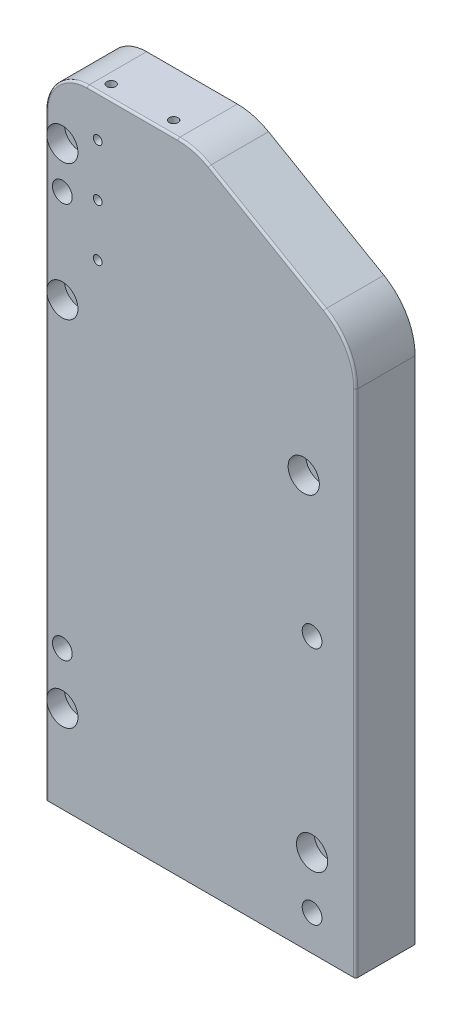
ISO-10303-21;
HEADER;
FILE_DESCRIPTION(('STEP AP214'),'2;1');
FILE_NAME('part.step','',(''),(''),'','','');
FILE_SCHEMA(('AUTOMOTIVE_DESIGN { 1 0 10303 214 1 1 1 1 }'));
ENDSEC;
DATA;
#1=APPLICATION_CONTEXT('core data for automotive mechanical design processes');
#2=APPLICATION_PROTOCOL_DEFINITION('international standard','automotive_design',2000,#1);
#3=PRODUCT_CONTEXT('',#1,'mechanical');
#4=PRODUCT('Part','Part','',(#3));
#5=PRODUCT_RELATED_PRODUCT_CATEGORY('part','',(#4));
#6=PRODUCT_DEFINITION_FORMATION('','',#4);
#7=PRODUCT_DEFINITION_CONTEXT('part definition',#1,'design');
#8=PRODUCT_DEFINITION('design','',#6,#7);
#9=PRODUCT_DEFINITION_SHAPE('','',#8);
#10=(LENGTH_UNIT() NAMED_UNIT(*) SI_UNIT(.MILLI.,.METRE.));
#11=(NAMED_UNIT(*) PLANE_ANGLE_UNIT() SI_UNIT($,.RADIAN.));
#12=(NAMED_UNIT(*) SI_UNIT($,.STERADIAN.) SOLID_ANGLE_UNIT());
#13=UNCERTAINTY_MEASURE_WITH_UNIT(LENGTH_MEASURE(1.E-05),#10,'distance_accuracy_value','');
#14=(GEOMETRIC_REPRESENTATION_CONTEXT(3) GLOBAL_UNCERTAINTY_ASSIGNED_CONTEXT((#13)) GLOBAL_UNIT_ASSIGNED_CONTEXT((#10,
#11,#12)) REPRESENTATION_CONTEXT('',''));
#15=CARTESIAN_POINT('',(0.,0.,0.));
#16=DIRECTION('',(0.,0.,1.));
#17=DIRECTION('',(1.,0.,0.));
#18=AXIS2_PLACEMENT_3D('',#15,#16,#17);
#19=CARTESIAN_POINT('',(-104.,90.,28.5));
#20=DIRECTION('',(0.,0.,1.));
#21=DIRECTION('',(-1.,0.,0.));
#22=AXIS2_PLACEMENT_3D('',#19,#20,#21);
#23=PLANE('',#22);
#24=CARTESIAN_POINT('',(3.99999999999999,-155.,28.5));
#25=DIRECTION('',(0.,0.,1.));
#26=DIRECTION('',(1.,0.,0.));
#27=AXIS2_PLACEMENT_3D('',#24,#25,#26);
#28=CIRCLE('',#27,7.5);
#29=CARTESIAN_POINT('',(11.5,-155.,28.5));
#30=VERTEX_POINT('',#29);
#31=EDGE_CURVE('E1626',#30,#30,#28,.T.);
#32=ORIENTED_EDGE('',*,*,#31,.F.);
#33=EDGE_LOOP('',(#32));
#34=FACE_BOUND('',#33,.T.);
#35=CARTESIAN_POINT('',(-116.,-155.,28.5));
#36=DIRECTION('',(0.,0.,1.));
#37=DIRECTION('',(1.,0.,0.));
#38=AXIS2_PLACEMENT_3D('',#35,#36,#37);
#39=CIRCLE('',#38,7.49999999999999);
#40=CARTESIAN_POINT('',(-123.,-157.692582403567,28.5));
#41=VERTEX_POINT('',#40);
#42=CARTESIAN_POINT('',(-123.,-152.307417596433,28.5));
#43=VERTEX_POINT('',#42);
#44=EDGE_CURVE('E363',#41,#43,#39,.T.);
#45=ORIENTED_EDGE('',*,*,#44,.F.);
#46=DIRECTION('',(0.,-1.,0.));
#47=VECTOR('',#46,1.);
#48=CARTESIAN_POINT('',(-123.,90.,28.5));
#49=LINE('',#48,#47);
#50=CARTESIAN_POINT('',(-123.,-197.,28.5));
#51=VERTEX_POINT('',#50);
#52=EDGE_CURVE('E601',#51,#41,#49,.F.);
#53=ORIENTED_EDGE('',*,*,#52,.F.);
#54=DIRECTION('',(1.,0.,0.));
#55=VECTOR('',#54,1.);
#56=CARTESIAN_POINT('',(-124.,-197.,28.5));
#57=LINE('',#56,#55);
#58=CARTESIAN_POINT('',(24.,-197.,28.5));
#59=VERTEX_POINT('',#58);
#60=EDGE_CURVE('E825',#51,#59,#57,.T.);
#61=ORIENTED_EDGE('',*,*,#60,.T.);
#62=DIRECTION('',(0.,1.,0.));
#63=VECTOR('',#62,1.);
#64=CARTESIAN_POINT('',(24.,90.,28.5));
#65=LINE('',#64,#63);
#66=CARTESIAN_POINT('',(24.,48.,28.5));
#67=VERTEX_POINT('',#66);
#68=EDGE_CURVE('E1870',#67,#59,#65,.F.);
#69=ORIENTED_EDGE('',*,*,#68,.F.);
#70=CARTESIAN_POINT('',(-5.00000000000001,48.,28.5));
#71=DIRECTION('',(0.,0.,-1.));
#72=DIRECTION('',(-1.,0.,0.));
#73=AXIS2_PLACEMENT_3D('',#70,#71,#72);
#74=CIRCLE('',#73,29.);
#75=CARTESIAN_POINT('',(9.50000000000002,73.1147367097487,28.5));
#76=VERTEX_POINT('',#75);
#77=EDGE_CURVE('E614',#76,#67,#74,.T.);
#78=ORIENTED_EDGE('',*,*,#77,.F.);
#79=DIRECTION('',(-0.866025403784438,0.500000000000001,0.));
#80=VECTOR('',#79,1.);
#81=CARTESIAN_POINT('',(-82.9365334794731,126.482994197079,28.5));
#82=LINE('',#81,#80);
#83=CARTESIAN_POINT('',(-45.9256258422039,105.114736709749,28.5));
#84=VERTEX_POINT('',#83);
#85=EDGE_CURVE('E610',#84,#76,#82,.F.);
#86=ORIENTED_EDGE('',*,*,#85,.F.);
#87=CARTESIAN_POINT('',(-60.4256258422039,80.,28.5));
#88=DIRECTION('',(0.,0.,-1.));
#89=DIRECTION('',(-1.,0.,0.));
#90=AXIS2_PLACEMENT_3D('',#87,#88,#89);
#91=CIRCLE('',#90,29.);
#92=CARTESIAN_POINT('',(-60.4256258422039,109.,28.5));
#93=VERTEX_POINT('',#92);
#94=EDGE_CURVE('E618',#93,#84,#91,.T.);
#95=ORIENTED_EDGE('',*,*,#94,.F.);
#96=DIRECTION('',(-1.,0.,0.));
#97=VECTOR('',#96,1.);
#98=CARTESIAN_POINT('',(-104.,109.,28.5));
#99=LINE('',#98,#97);
#100=CARTESIAN_POINT('',(-104.,109.,28.5));
#101=VERTEX_POINT('',#100);
#102=EDGE_CURVE('E628',#101,#93,#99,.F.);
#103=ORIENTED_EDGE('',*,*,#102,.F.);
#104=CARTESIAN_POINT('',(-104.,90.,28.5));
#105=DIRECTION('',(0.,0.,-1.));
#106=DIRECTION('',(-1.,0.,0.));
#107=AXIS2_PLACEMENT_3D('',#104,#105,#106);
#108=CIRCLE('',#107,19.);
#109=CARTESIAN_POINT('',(-123.,90.,28.5));
#110=VERTEX_POINT('',#109);
#111=EDGE_CURVE('E623',#110,#101,#108,.T.);
#112=ORIENTED_EDGE('',*,*,#111,.F.);
#113=CARTESIAN_POINT('',(-123.,82.6925824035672,28.5));
#114=VERTEX_POINT('',#113);
#115=EDGE_CURVE('E612',#114,#110,#49,.F.);
#116=ORIENTED_EDGE('',*,*,#115,.F.);
#117=CARTESIAN_POINT('',(-116.,80.,28.5));
#118=DIRECTION('',(0.,0.,1.));
#119=DIRECTION('',(1.,0.,0.));
#120=AXIS2_PLACEMENT_3D('',#117,#118,#119);
#121=CIRCLE('',#120,7.49999999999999);
#122=CARTESIAN_POINT('',(-123.,77.3074175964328,28.5));
#123=VERTEX_POINT('',#122);
#124=EDGE_CURVE('E1319',#123,#114,#121,.T.);
#125=ORIENTED_EDGE('',*,*,#124,.F.);
#126=CARTESIAN_POINT('',(-123.,17.6925824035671,28.5));
#127=VERTEX_POINT('',#126);
#128=EDGE_CURVE('E616',#127,#123,#49,.F.);
#129=ORIENTED_EDGE('',*,*,#128,.F.);
#130=CARTESIAN_POINT('',(-116.,15.,28.5));
#131=DIRECTION('',(0.,0.,1.));
#132=DIRECTION('',(1.,0.,0.));
#133=AXIS2_PLACEMENT_3D('',#130,#131,#132);
#134=CIRCLE('',#133,7.49999999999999);
#135=CARTESIAN_POINT('',(-123.,12.3074175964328,28.5));
#136=VERTEX_POINT('',#135);
#137=EDGE_CURVE('E370',#136,#127,#134,.T.);
#138=ORIENTED_EDGE('',*,*,#137,.F.);
#139=EDGE_CURVE('E602',#43,#136,#49,.F.);
#140=ORIENTED_EDGE('',*,*,#139,.F.);
#141=EDGE_LOOP('',(#45,#53,#61,#69,#78,#86,#95,#103,#112,#116,#125,#129,#138,#140));
#142=FACE_BOUND('',#141,.T.);
#143=CARTESIAN_POINT('',(0.,0.,28.5));
#144=DIRECTION('',(0.,0.,-1.));
#145=DIRECTION('',(-1.,0.,0.));
#146=AXIS2_PLACEMENT_3D('',#143,#144,#145);
#147=CIRCLE('',#146,7.5);
#148=CARTESIAN_POINT('',(-7.5,0.,28.5));
#149=VERTEX_POINT('',#148);
#150=EDGE_CURVE('E641',#149,#149,#147,.T.);
#151=ORIENTED_EDGE('',*,*,#150,.T.);
#152=EDGE_LOOP('',(#151));
#153=FACE_BOUND('',#152,.T.);
#154=CARTESIAN_POINT('',(4.00000000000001,-180.,28.5));
#155=DIRECTION('',(0.,0.,1.));
#156=DIRECTION('',(1.,0.,0.));
#157=AXIS2_PLACEMENT_3D('',#154,#155,#156);
#158=CIRCLE('',#157,4.75);
#159=CARTESIAN_POINT('',(8.75,-180.,28.5));
#160=VERTEX_POINT('',#159);
#161=EDGE_CURVE('E1208',#160,#160,#158,.T.);
#162=ORIENTED_EDGE('',*,*,#161,.F.);
#163=EDGE_LOOP('',(#162));
#164=FACE_BOUND('',#163,.T.);
#165=CARTESIAN_POINT('',(-116.,60.,28.5));
#166=DIRECTION('',(0.,0.,1.));
#167=DIRECTION('',(1.,0.,0.));
#168=AXIS2_PLACEMENT_3D('',#165,#166,#167);
#169=CIRCLE('',#168,4.74999999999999);
#170=CARTESIAN_POINT('',(-111.25,60.,28.5));
#171=VERTEX_POINT('',#170);
#172=EDGE_CURVE('E1211',#171,#171,#169,.T.);
#173=ORIENTED_EDGE('',*,*,#172,.F.);
#174=EDGE_LOOP('',(#173));
#175=FACE_BOUND('',#174,.T.);
#176=CARTESIAN_POINT('',(4.00000000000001,-65.,28.5));
#177=DIRECTION('',(0.,0.,1.));
#178=DIRECTION('',(1.,0.,0.));
#179=AXIS2_PLACEMENT_3D('',#176,#177,#178);
#180=CIRCLE('',#179,4.75);
#181=CARTESIAN_POINT('',(8.75,-65.,28.5));
#182=VERTEX_POINT('',#181);
#183=EDGE_CURVE('E1214',#182,#182,#180,.T.);
#184=ORIENTED_EDGE('',*,*,#183,.F.);
#185=EDGE_LOOP('',(#184));
#186=FACE_BOUND('',#185,.T.);
#187=CARTESIAN_POINT('',(-116.,-130.,28.5));
#188=DIRECTION('',(0.,0.,1.));
#189=DIRECTION('',(1.,0.,0.));
#190=AXIS2_PLACEMENT_3D('',#187,#188,#189);
#191=CIRCLE('',#190,4.74999999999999);
#192=CARTESIAN_POINT('',(-111.25,-130.,28.5));
#193=VERTEX_POINT('',#192);
#194=EDGE_CURVE('E1217',#193,#193,#191,.T.);
#195=ORIENTED_EDGE('',*,*,#194,.F.);
#196=EDGE_LOOP('',(#195));
#197=FACE_BOUND('',#196,.T.);
#198=CARTESIAN_POINT('',(-99.,90.,28.5));
#199=DIRECTION('',(0.,0.,1.));
#200=DIRECTION('',(1.,0.,0.));
#201=AXIS2_PLACEMENT_3D('',#198,#199,#200);
#202=CIRCLE('',#201,2.1);
#203=CARTESIAN_POINT('',(-96.9,90.,28.5));
#204=VERTEX_POINT('',#203);
#205=EDGE_CURVE('E1223',#204,#204,#202,.T.);
#206=ORIENTED_EDGE('',*,*,#205,.F.);
#207=EDGE_LOOP('',(#206));
#208=FACE_BOUND('',#207,.T.);
#209=CARTESIAN_POINT('',(-99.,40.,28.5));
#210=DIRECTION('',(0.,0.,1.));
#211=DIRECTION('',(1.,0.,0.));
#212=AXIS2_PLACEMENT_3D('',#209,#210,#211);
#213=CIRCLE('',#212,2.1);
#214=CARTESIAN_POINT('',(-96.9,40.,28.5));
#215=VERTEX_POINT('',#214);
#216=EDGE_CURVE('E1229',#215,#215,#213,.T.);
#217=ORIENTED_EDGE('',*,*,#216,.F.);
#218=EDGE_LOOP('',(#217));
#219=FACE_BOUND('',#218,.T.);
#220=CARTESIAN_POINT('',(-98.9999999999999,65.,28.5));
#221=DIRECTION('',(0.,0.,1.));
#222=DIRECTION('',(1.,0.,0.));
#223=AXIS2_PLACEMENT_3D('',#220,#221,#222);
#224=CIRCLE('',#223,2.1);
#225=CARTESIAN_POINT('',(-96.8999999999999,65.,28.5));
#226=VERTEX_POINT('',#225);
#227=EDGE_CURVE('E752',#226,#226,#224,.T.);
#228=ORIENTED_EDGE('',*,*,#227,.F.);
#229=EDGE_LOOP('',(#228));
#230=FACE_BOUND('',#229,.T.);
#231=ADVANCED_FACE('F348',(#34,#142,#153,#164,#175,#186,#197,#208,#219,#230),#23,.T.);
#232=CARTESIAN_POINT('',(-104.,90.,0.));
#233=DIRECTION('',(0.,0.,1.));
#234=DIRECTION('',(-1.,0.,0.));
#235=AXIS2_PLACEMENT_3D('',#232,#233,#234);
#236=PLANE('',#235);
#237=CARTESIAN_POINT('',(3.99999999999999,-155.,0.));
#238=DIRECTION('',(0.,0.,1.));
#239=DIRECTION('',(1.,0.,0.));
#240=AXIS2_PLACEMENT_3D('',#237,#238,#239);
#241=CIRCLE('',#240,4.19999999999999);
#242=CARTESIAN_POINT('',(8.19999999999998,-155.,0.));
#243=VERTEX_POINT('',#242);
#244=EDGE_CURVE('E352',#243,#243,#241,.T.);
#245=ORIENTED_EDGE('',*,*,#244,.T.);
#246=EDGE_LOOP('',(#245));
#247=FACE_BOUND('',#246,.T.);
#248=CARTESIAN_POINT('',(-116.,-155.,0.));
#249=DIRECTION('',(0.,0.,1.));
#250=DIRECTION('',(1.,0.,0.));
#251=AXIS2_PLACEMENT_3D('',#248,#249,#250);
#252=CIRCLE('',#251,4.2);
#253=CARTESIAN_POINT('',(-111.8,-155.,0.));
#254=VERTEX_POINT('',#253);
#255=EDGE_CURVE('E603',#254,#254,#252,.T.);
#256=ORIENTED_EDGE('',*,*,#255,.T.);
#257=EDGE_LOOP('',(#256));
#258=FACE_BOUND('',#257,.T.);
#259=CARTESIAN_POINT('',(-116.,15.,0.));
#260=DIRECTION('',(0.,0.,1.));
#261=DIRECTION('',(1.,0.,0.));
#262=AXIS2_PLACEMENT_3D('',#259,#260,#261);
#263=CIRCLE('',#262,4.2);
#264=CARTESIAN_POINT('',(-111.8,15.,0.));
#265=VERTEX_POINT('',#264);
#266=EDGE_CURVE('E1291',#265,#265,#263,.T.);
#267=ORIENTED_EDGE('',*,*,#266,.T.);
#268=EDGE_LOOP('',(#267));
#269=FACE_BOUND('',#268,.T.);
#270=CARTESIAN_POINT('',(-116.,80.,0.));
#271=DIRECTION('',(0.,0.,1.));
#272=DIRECTION('',(1.,0.,0.));
#273=AXIS2_PLACEMENT_3D('',#270,#271,#272);
#274=CIRCLE('',#273,4.2);
#275=CARTESIAN_POINT('',(-111.8,80.,0.));
#276=VERTEX_POINT('',#275);
#277=EDGE_CURVE('E1290',#276,#276,#274,.T.);
#278=ORIENTED_EDGE('',*,*,#277,.T.);
#279=EDGE_LOOP('',(#278));
#280=FACE_BOUND('',#279,.T.);
#281=CARTESIAN_POINT('',(-116.,60.,0.));
#282=DIRECTION('',(0.,0.,1.));
#283=DIRECTION('',(1.,0.,0.));
#284=AXIS2_PLACEMENT_3D('',#281,#282,#283);
#285=CIRCLE('',#284,5.01);
#286=CARTESIAN_POINT('',(-110.99,60.,0.));
#287=VERTEX_POINT('',#286);
#288=EDGE_CURVE('E640',#287,#287,#285,.T.);
#289=ORIENTED_EDGE('',*,*,#288,.T.);
#290=EDGE_LOOP('',(#289));
#291=FACE_BOUND('',#290,.T.);
#292=CARTESIAN_POINT('',(-116.,-130.,0.));
#293=DIRECTION('',(0.,0.,1.));
#294=DIRECTION('',(1.,0.,0.));
#295=AXIS2_PLACEMENT_3D('',#292,#293,#294);
#296=CIRCLE('',#295,5.01);
#297=CARTESIAN_POINT('',(-110.99,-130.,0.));
#298=VERTEX_POINT('',#297);
#299=EDGE_CURVE('E645',#298,#298,#296,.T.);
#300=ORIENTED_EDGE('',*,*,#299,.T.);
#301=EDGE_LOOP('',(#300));
#302=FACE_BOUND('',#301,.T.);
#303=CARTESIAN_POINT('',(4.00000000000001,-180.,0.));
#304=DIRECTION('',(0.,0.,1.));
#305=DIRECTION('',(1.,0.,0.));
#306=AXIS2_PLACEMENT_3D('',#303,#304,#305);
#307=CIRCLE('',#306,5.01);
#308=CARTESIAN_POINT('',(9.01000000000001,-180.,0.));
#309=VERTEX_POINT('',#308);
#310=EDGE_CURVE('E650',#309,#309,#307,.T.);
#311=ORIENTED_EDGE('',*,*,#310,.T.);
#312=EDGE_LOOP('',(#311));
#313=FACE_BOUND('',#312,.T.);
#314=CARTESIAN_POINT('',(4.00000000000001,-65.,0.));
#315=DIRECTION('',(0.,0.,1.));
#316=DIRECTION('',(1.,0.,0.));
#317=AXIS2_PLACEMENT_3D('',#314,#315,#316);
#318=CIRCLE('',#317,5.01);
#319=CARTESIAN_POINT('',(9.01000000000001,-65.,0.));
#320=VERTEX_POINT('',#319);
#321=EDGE_CURVE('E655',#320,#320,#318,.T.);
#322=ORIENTED_EDGE('',*,*,#321,.T.);
#323=EDGE_LOOP('',(#322));
#324=FACE_BOUND('',#323,.T.);
#325=CARTESIAN_POINT('',(-60.,-55.,0.));
#326=DIRECTION('',(0.,0.,-1.));
#327=DIRECTION('',(-1.,0.,0.));
#328=AXIS2_PLACEMENT_3D('',#325,#326,#327);
#329=CIRCLE('',#328,30.);
#330=CARTESIAN_POINT('',(-60.,-85.,0.));
#331=VERTEX_POINT('',#330);
#332=CARTESIAN_POINT('',(-90.,-55.,0.));
#333=VERTEX_POINT('',#332);
#334=EDGE_CURVE('E779',#331,#333,#329,.T.);
#335=ORIENTED_EDGE('',*,*,#334,.F.);
#336=DIRECTION('',(-1.,0.,0.));
#337=VECTOR('',#336,1.);
#338=CARTESIAN_POINT('',(-104.,-85.,0.));
#339=LINE('',#338,#337);
#340=CARTESIAN_POINT('',(-59.5,-85.,0.));
#341=VERTEX_POINT('',#340);
#342=EDGE_CURVE('E753',#341,#331,#339,.T.);
#343=ORIENTED_EDGE('',*,*,#342,.F.);
#344=CARTESIAN_POINT('',(-59.5,-55.,0.));
#345=DIRECTION('',(0.,0.,-1.));
#346=DIRECTION('',(-1.,0.,0.));
#347=AXIS2_PLACEMENT_3D('',#344,#345,#346);
#348=CIRCLE('',#347,30.);
#349=CARTESIAN_POINT('',(-29.5,-55.,0.));
#350=VERTEX_POINT('',#349);
#351=EDGE_CURVE('E760',#350,#341,#348,.T.);
#352=ORIENTED_EDGE('',*,*,#351,.F.);
#353=DIRECTION('',(0.,-1.,0.));
#354=VECTOR('',#353,1.);
#355=CARTESIAN_POINT('',(-29.5,90.,0.));
#356=LINE('',#355,#354);
#357=CARTESIAN_POINT('',(-29.5,41.838,0.));
#358=VERTEX_POINT('',#357);
#359=EDGE_CURVE('E763',#358,#350,#356,.T.);
#360=ORIENTED_EDGE('',*,*,#359,.F.);
#361=DIRECTION('',(-0.024956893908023,-0.999688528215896,0.));
#362=VECTOR('',#361,1.);
#363=CARTESIAN_POINT('',(-28.3448025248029,88.1112929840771,0.));
#364=LINE('',#363,#362);
#365=CARTESIAN_POINT('',(-28.7923441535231,70.1842931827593,0.));
#366=VERTEX_POINT('',#365);
#367=EDGE_CURVE('E688',#366,#358,#364,.T.);
#368=ORIENTED_EDGE('',*,*,#367,.F.);
#369=CARTESIAN_POINT('',(-58.783,70.933,0.));
#370=DIRECTION('',(0.,0.,-1.));
#371=DIRECTION('',(-1.,0.,0.));
#372=AXIS2_PLACEMENT_3D('',#369,#370,#371);
#373=CIRCLE('',#372,30.);
#374=CARTESIAN_POINT('',(-58.783,100.933,0.));
#375=VERTEX_POINT('',#374);
#376=EDGE_CURVE('E691',#375,#366,#373,.T.);
#377=ORIENTED_EDGE('',*,*,#376,.F.);
#378=DIRECTION('',(1.,0.,0.));
#379=VECTOR('',#378,1.);
#380=CARTESIAN_POINT('',(-104.,100.933,0.));
#381=LINE('',#380,#379);
#382=CARTESIAN_POINT('',(-59.278,100.933,0.));
#383=VERTEX_POINT('',#382);
#384=EDGE_CURVE('E694',#383,#375,#381,.T.);
#385=ORIENTED_EDGE('',*,*,#384,.F.);
#386=CARTESIAN_POINT('',(-59.278,70.933,0.));
#387=DIRECTION('',(0.,0.,-1.));
#388=DIRECTION('',(-1.,0.,0.));
#389=AXIS2_PLACEMENT_3D('',#386,#387,#388);
#390=CIRCLE('',#389,30.);
#391=CARTESIAN_POINT('',(-74.5478307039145,96.7560956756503,0.));
#392=VERTEX_POINT('',#391);
#393=EDGE_CURVE('E697',#392,#383,#390,.T.);
#394=ORIENTED_EDGE('',*,*,#393,.F.);
#395=CARTESIAN_POINT('',(-80.5,96.,0.));
#396=DIRECTION('',(0.,0.,-1.));
#397=DIRECTION('',(-1.,0.,0.));
#398=AXIS2_PLACEMENT_3D('',#395,#396,#397);
#399=CIRCLE('',#398,6.);
#400=CARTESIAN_POINT('',(-80.5,102.,0.));
#401=VERTEX_POINT('',#400);
#402=EDGE_CURVE('E700',#401,#392,#399,.T.);
#403=ORIENTED_EDGE('',*,*,#402,.F.);
#404=DIRECTION('',(1.,0.,0.));
#405=VECTOR('',#404,1.);
#406=CARTESIAN_POINT('',(-104.,102.,0.));
#407=LINE('',#406,#405);
#408=CARTESIAN_POINT('',(-99.,102.,0.));
#409=VERTEX_POINT('',#408);
#410=EDGE_CURVE('E702',#409,#401,#407,.T.);
#411=ORIENTED_EDGE('',*,*,#410,.F.);
#412=CARTESIAN_POINT('',(-99.,96.,0.));
#413=DIRECTION('',(0.,0.,-1.));
#414=DIRECTION('',(-1.,0.,0.));
#415=AXIS2_PLACEMENT_3D('',#412,#413,#414);
#416=CIRCLE('',#415,6.00000000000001);
#417=CARTESIAN_POINT('',(-105.,96.,0.));
#418=VERTEX_POINT('',#417);
#419=EDGE_CURVE('E636',#418,#409,#416,.T.);
#420=ORIENTED_EDGE('',*,*,#419,.F.);
#421=DIRECTION('',(0.,1.,0.));
#422=VECTOR('',#421,1.);
#423=CARTESIAN_POINT('',(-105.,90.,0.));
#424=LINE('',#423,#422);
#425=CARTESIAN_POINT('',(-105.,33.,0.));
#426=VERTEX_POINT('',#425);
#427=EDGE_CURVE('E766',#426,#418,#424,.T.);
#428=ORIENTED_EDGE('',*,*,#427,.F.);
#429=CARTESIAN_POINT('',(-99.,33.,0.));
#430=DIRECTION('',(0.,0.,-1.));
#431=DIRECTION('',(-1.,0.,0.));
#432=AXIS2_PLACEMENT_3D('',#429,#430,#431);
#433=CIRCLE('',#432,6.00000000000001);
#434=CARTESIAN_POINT('',(-99.,27.,0.));
#435=VERTEX_POINT('',#434);
#436=EDGE_CURVE('E768',#435,#426,#433,.T.);
#437=ORIENTED_EDGE('',*,*,#436,.F.);
#438=DIRECTION('',(-1.,0.,0.));
#439=VECTOR('',#438,1.);
#440=CARTESIAN_POINT('',(-104.,27.,0.));
#441=LINE('',#440,#439);
#442=CARTESIAN_POINT('',(-90.,27.,0.));
#443=VERTEX_POINT('',#442);
#444=EDGE_CURVE('E756',#443,#435,#441,.T.);
#445=ORIENTED_EDGE('',*,*,#444,.F.);
#446=DIRECTION('',(0.,1.,0.));
#447=VECTOR('',#446,1.);
#448=CARTESIAN_POINT('',(-90.,90.,0.));
#449=LINE('',#448,#447);
#450=EDGE_CURVE('E782',#333,#443,#449,.T.);
#451=ORIENTED_EDGE('',*,*,#450,.F.);
#452=EDGE_LOOP('',(#335,#343,#352,#360,#368,#377,#385,#394,#403,#411,#420,#428,#437,#445,#451));
#453=FACE_BOUND('',#452,.T.);
#454=CARTESIAN_POINT('',(0.,0.,0.));
#455=DIRECTION('',(0.,0.,-1.));
#456=DIRECTION('',(-1.,0.,0.));
#457=AXIS2_PLACEMENT_3D('',#454,#455,#456);
#458=CIRCLE('',#457,23.8);
#459=CARTESIAN_POINT('',(-23.8,0.,0.));
#460=VERTEX_POINT('',#459);
#461=EDGE_CURVE('E682',#460,#460,#458,.T.);
#462=ORIENTED_EDGE('',*,*,#461,.F.);
#463=EDGE_LOOP('',(#462));
#464=FACE_BOUND('',#463,.T.);
#465=DIRECTION('',(0.,-1.,0.));
#466=VECTOR('',#465,1.);
#467=CARTESIAN_POINT('',(-87.5,17.,0.));
#468=LINE('',#467,#466);
#469=CARTESIAN_POINT('',(-87.5,-172.,0.));
#470=VERTEX_POINT('',#469);
#471=CARTESIAN_POINT('',(-87.5,-197.,0.));
#472=VERTEX_POINT('',#471);
#473=EDGE_CURVE('E1206',#470,#472,#468,.T.);
#474=ORIENTED_EDGE('',*,*,#473,.T.);
#475=DIRECTION('',(1.,0.,0.));
#476=VECTOR('',#475,1.);
#477=CARTESIAN_POINT('',(-124.,-197.,0.));
#478=LINE('',#477,#476);
#479=CARTESIAN_POINT('',(-124.,-197.,0.));
#480=VERTEX_POINT('',#479);
#481=EDGE_CURVE('E1203',#480,#472,#478,.T.);
#482=ORIENTED_EDGE('',*,*,#481,.F.);
#483=DIRECTION('',(0.,-1.,0.));
#484=VECTOR('',#483,1.);
#485=CARTESIAN_POINT('',(-124.,-197.,0.));
#486=LINE('',#485,#484);
#487=CARTESIAN_POINT('',(-124.,90.,0.));
#488=VERTEX_POINT('',#487);
#489=EDGE_CURVE('E1202',#488,#480,#486,.T.);
#490=ORIENTED_EDGE('',*,*,#489,.F.);
#491=CARTESIAN_POINT('',(-104.,90.,0.));
#492=DIRECTION('',(0.,0.,1.));
#493=DIRECTION('',(-1.,0.,0.));
#494=AXIS2_PLACEMENT_3D('',#491,#492,#493);
#495=CIRCLE('',#494,20.);
#496=CARTESIAN_POINT('',(-104.,110.,0.));
#497=VERTEX_POINT('',#496);
#498=EDGE_CURVE('E672',#497,#488,#495,.T.);
#499=ORIENTED_EDGE('',*,*,#498,.F.);
#500=DIRECTION('',(-1.,0.,0.));
#501=VECTOR('',#500,1.);
#502=CARTESIAN_POINT('',(-104.,110.,0.));
#503=LINE('',#502,#501);
#504=CARTESIAN_POINT('',(-60.4256258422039,110.,0.));
#505=VERTEX_POINT('',#504);
#506=EDGE_CURVE('E821',#505,#497,#503,.T.);
#507=ORIENTED_EDGE('',*,*,#506,.F.);
#508=CARTESIAN_POINT('',(-60.4256258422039,80.,0.));
#509=DIRECTION('',(0.,0.,1.));
#510=DIRECTION('',(-1.,0.,0.));
#511=AXIS2_PLACEMENT_3D('',#508,#509,#510);
#512=CIRCLE('',#511,30.);
#513=CARTESIAN_POINT('',(-45.4256258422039,105.980762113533,0.));
#514=VERTEX_POINT('',#513);
#515=EDGE_CURVE('E818',#514,#505,#512,.T.);
#516=ORIENTED_EDGE('',*,*,#515,.F.);
#517=DIRECTION('',(-0.866025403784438,0.500000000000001,0.));
#518=VECTOR('',#517,1.);
#519=CARTESIAN_POINT('',(-45.4256258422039,105.980762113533,0.));
#520=LINE('',#519,#518);
#521=CARTESIAN_POINT('',(10.,73.9807621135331,0.));
#522=VERTEX_POINT('',#521);
#523=EDGE_CURVE('E815',#522,#514,#520,.T.);
#524=ORIENTED_EDGE('',*,*,#523,.F.);
#525=CARTESIAN_POINT('',(-5.00000000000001,48.,0.));
#526=DIRECTION('',(0.,0.,1.));
#527=DIRECTION('',(-1.,0.,0.));
#528=AXIS2_PLACEMENT_3D('',#525,#526,#527);
#529=CIRCLE('',#528,30.);
#530=CARTESIAN_POINT('',(25.,48.,0.));
#531=VERTEX_POINT('',#530);
#532=EDGE_CURVE('E812',#531,#522,#529,.T.);
#533=ORIENTED_EDGE('',*,*,#532,.F.);
#534=DIRECTION('',(0.,1.,0.));
#535=VECTOR('',#534,1.);
#536=CARTESIAN_POINT('',(25.,48.,0.));
#537=LINE('',#536,#535);
#538=CARTESIAN_POINT('',(25.,-197.,0.));
#539=VERTEX_POINT('',#538);
#540=EDGE_CURVE('E666',#539,#531,#537,.T.);
#541=ORIENTED_EDGE('',*,*,#540,.F.);
#542=CARTESIAN_POINT('',(-32.5,-197.,0.));
#543=VERTEX_POINT('',#542);
#544=EDGE_CURVE('E1200',#543,#539,#478,.T.);
#545=ORIENTED_EDGE('',*,*,#544,.F.);
#546=DIRECTION('',(0.,1.,0.));
#547=VECTOR('',#546,1.);
#548=CARTESIAN_POINT('',(-32.5,-38.7313579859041,0.));
#549=LINE('',#548,#547);
#550=CARTESIAN_POINT('',(-32.5,-172.,0.));
#551=VERTEX_POINT('',#550);
#552=EDGE_CURVE('E660',#543,#551,#549,.T.);
#553=ORIENTED_EDGE('',*,*,#552,.T.);
#554=CARTESIAN_POINT('',(-60.,-172.,0.));
#555=DIRECTION('',(0.,0.,-1.));
#556=DIRECTION('',(-1.,0.,0.));
#557=AXIS2_PLACEMENT_3D('',#554,#555,#556);
#558=CIRCLE('',#557,27.5);
#559=EDGE_CURVE('E804',#470,#551,#558,.T.);
#560=ORIENTED_EDGE('',*,*,#559,.F.);
#561=EDGE_LOOP('',(#474,#482,#490,#499,#507,#516,#524,#533,#541,#545,#553,#560));
#562=FACE_BOUND('',#561,.T.);
#563=ADVANCED_FACE('F719',(#247,#258,#269,#280,#291,#302,#313,#324,#453,#464,#562),#236,.F.);
#564=CARTESIAN_POINT('',(25.,48.,28.5));
#565=DIRECTION('',(1.,0.,0.));
#566=DIRECTION('',(0.,1.,0.));
#567=AXIS2_PLACEMENT_3D('',#564,#565,#566);
#568=PLANE('',#567);
#569=DIRECTION('',(0.,0.,-1.));
#570=VECTOR('',#569,1.);
#571=CARTESIAN_POINT('',(25.,-197.,28.5));
#572=LINE('',#571,#570);
#573=CARTESIAN_POINT('',(25.,-197.,27.5));
#574=VERTEX_POINT('',#573);
#575=EDGE_CURVE('E679',#574,#539,#572,.T.);
#576=ORIENTED_EDGE('',*,*,#575,.T.);
#577=ORIENTED_EDGE('',*,*,#540,.T.);
#578=DIRECTION('',(0.,0.,-1.));
#579=VECTOR('',#578,1.);
#580=CARTESIAN_POINT('',(25.,48.,28.5));
#581=LINE('',#580,#579);
#582=CARTESIAN_POINT('',(25.,48.,27.5));
#583=VERTEX_POINT('',#582);
#584=EDGE_CURVE('E827',#583,#531,#581,.T.);
#585=ORIENTED_EDGE('',*,*,#584,.F.);
#586=DIRECTION('',(0.,1.,0.));
#587=VECTOR('',#586,1.);
#588=CARTESIAN_POINT('',(25.,48.,27.5));
#589=LINE('',#588,#587);
#590=EDGE_CURVE('E633',#574,#583,#589,.T.);
#591=ORIENTED_EDGE('',*,*,#590,.F.);
#592=EDGE_LOOP('',(#576,#577,#585,#591));
#593=FACE_BOUND('',#592,.T.);
#594=ADVANCED_FACE('F350',(#593),#568,.T.);
#595=CARTESIAN_POINT('',(-124.,-197.,28.5));
#596=DIRECTION('',(0.,-1.,0.));
#597=DIRECTION('',(0.,0.,1.));
#598=AXIS2_PLACEMENT_3D('',#595,#596,#597);
#599=PLANE('',#598);
#600=ORIENTED_EDGE('',*,*,#60,.F.);
#601=CARTESIAN_POINT('',(-123.,-197.,27.5));
#602=DIRECTION('',(0.,1.,0.));
#603=DIRECTION('',(0.,0.,1.));
#604=AXIS2_PLACEMENT_3D('',#601,#602,#603);
#605=CIRCLE('',#604,1.);
#606=CARTESIAN_POINT('',(-124.,-197.,27.5));
#607=VERTEX_POINT('',#606);
#608=EDGE_CURVE('E608',#607,#51,#605,.T.);
#609=ORIENTED_EDGE('',*,*,#608,.F.);
#610=DIRECTION('',(0.,0.,-1.));
#611=VECTOR('',#610,1.);
#612=CARTESIAN_POINT('',(-124.,-197.,28.5));
#613=LINE('',#612,#611);
#614=EDGE_CURVE('E829',#607,#480,#613,.T.);
#615=ORIENTED_EDGE('',*,*,#614,.T.);
#616=ORIENTED_EDGE('',*,*,#481,.T.);
#617=DIRECTION('',(0.,0.,1.));
#618=VECTOR('',#617,1.);
#619=CARTESIAN_POINT('',(-87.5,-197.,-24.));
#620=LINE('',#619,#618);
#621=CARTESIAN_POINT('',(-87.5,-197.,6.));
#622=VERTEX_POINT('',#621);
#623=EDGE_CURVE('E662',#472,#622,#620,.T.);
#624=ORIENTED_EDGE('',*,*,#623,.T.);
#625=DIRECTION('',(1.,0.,0.));
#626=VECTOR('',#625,1.);
#627=CARTESIAN_POINT('',(-87.5,-197.,6.));
#628=LINE('',#627,#626);
#629=CARTESIAN_POINT('',(-32.5,-197.,6.));
#630=VERTEX_POINT('',#629);
#631=EDGE_CURVE('E791',#622,#630,#628,.T.);
#632=ORIENTED_EDGE('',*,*,#631,.T.);
#633=DIRECTION('',(0.,0.,1.));
#634=VECTOR('',#633,1.);
#635=CARTESIAN_POINT('',(-32.5,-197.,-24.));
#636=LINE('',#635,#634);
#637=EDGE_CURVE('E667',#543,#630,#636,.T.);
#638=ORIENTED_EDGE('',*,*,#637,.F.);
#639=ORIENTED_EDGE('',*,*,#544,.T.);
#640=ORIENTED_EDGE('',*,*,#575,.F.);
#641=CARTESIAN_POINT('',(24.,-197.,27.5));
#642=DIRECTION('',(0.,1.,0.));
#643=DIRECTION('',(0.,0.,1.));
#644=AXIS2_PLACEMENT_3D('',#641,#642,#643);
#645=CIRCLE('',#644,1.);
#646=EDGE_CURVE('E871',#59,#574,#645,.T.);
#647=ORIENTED_EDGE('',*,*,#646,.F.);
#648=EDGE_LOOP('',(#600,#609,#615,#616,#624,#632,#638,#639,#640,#647));
#649=FACE_BOUND('',#648,.T.);
#650=ADVANCED_FACE('F1003',(#649),#599,.T.);
#651=CARTESIAN_POINT('',(-124.,-197.,28.5));
#652=DIRECTION('',(-1.,0.,0.));
#653=DIRECTION('',(0.,-1.,0.));
#654=AXIS2_PLACEMENT_3D('',#651,#652,#653);
#655=PLANE('',#654);
#656=DIRECTION('',(0.,0.,-1.));
#657=VECTOR('',#656,1.);
#658=CARTESIAN_POINT('',(-124.,90.,28.5));
#659=LINE('',#658,#657);
#660=CARTESIAN_POINT('',(-124.,90.,27.5));
#661=VERTEX_POINT('',#660);
#662=EDGE_CURVE('E831',#661,#488,#659,.T.);
#663=ORIENTED_EDGE('',*,*,#662,.T.);
#664=ORIENTED_EDGE('',*,*,#489,.T.);
#665=ORIENTED_EDGE('',*,*,#614,.F.);
#666=DIRECTION('',(0.,-1.,0.));
#667=VECTOR('',#666,1.);
#668=CARTESIAN_POINT('',(-124.,-197.,27.5));
#669=LINE('',#668,#667);
#670=EDGE_CURVE('E867',#661,#607,#669,.T.);
#671=ORIENTED_EDGE('',*,*,#670,.F.);
#672=EDGE_LOOP('',(#663,#664,#665,#671));
#673=FACE_BOUND('',#672,.T.);
#674=ADVANCED_FACE('F1006',(#673),#655,.T.);
#675=CARTESIAN_POINT('',(-104.,90.,28.5));
#676=DIRECTION('',(0.,0.,-1.));
#677=DIRECTION('',(1.,0.,0.));
#678=AXIS2_PLACEMENT_3D('',#675,#676,#677);
#679=CYLINDRICAL_SURFACE('',#678,20.);
#680=DIRECTION('',(0.,0.,-1.));
#681=VECTOR('',#680,1.);
#682=CARTESIAN_POINT('',(-104.,110.,28.5));
#683=LINE('',#682,#681);
#684=CARTESIAN_POINT('',(-104.,110.,27.5));
#685=VERTEX_POINT('',#684);
#686=EDGE_CURVE('E833',#685,#497,#683,.T.);
#687=ORIENTED_EDGE('',*,*,#686,.T.);
#688=ORIENTED_EDGE('',*,*,#498,.T.);
#689=ORIENTED_EDGE('',*,*,#662,.F.);
#690=CARTESIAN_POINT('',(-104.,90.,27.5));
#691=DIRECTION('',(0.,0.,-1.));
#692=DIRECTION('',(-1.,0.,0.));
#693=AXIS2_PLACEMENT_3D('',#690,#691,#692);
#694=CIRCLE('',#693,20.);
#695=EDGE_CURVE('E877',#685,#661,#694,.F.);
#696=ORIENTED_EDGE('',*,*,#695,.F.);
#697=EDGE_LOOP('',(#687,#688,#689,#696));
#698=FACE_BOUND('',#697,.T.);
#699=ADVANCED_FACE('F1010',(#698),#679,.T.);
#700=CARTESIAN_POINT('',(-104.,110.,28.5));
#701=DIRECTION('',(0.,1.,0.));
#702=DIRECTION('',(-1.,0.,0.));
#703=AXIS2_PLACEMENT_3D('',#700,#701,#702);
#704=PLANE('',#703);
#705=CARTESIAN_POINT('',(-99.,110.,22.));
#706=DIRECTION('',(0.,-1.,0.));
#707=DIRECTION('',(0.,0.,-1.));
#708=AXIS2_PLACEMENT_3D('',#705,#706,#707);
#709=CIRCLE('',#708,2.1);
#710=CARTESIAN_POINT('',(-99.,110.,19.9));
#711=VERTEX_POINT('',#710);
#712=EDGE_CURVE('E980',#711,#711,#709,.T.);
#713=ORIENTED_EDGE('',*,*,#712,.T.);
#714=EDGE_LOOP('',(#713));
#715=FACE_BOUND('',#714,.T.);
#716=CARTESIAN_POINT('',(-69.,110.,22.));
#717=DIRECTION('',(0.,-1.,0.));
#718=DIRECTION('',(0.,0.,-1.));
#719=AXIS2_PLACEMENT_3D('',#716,#717,#718);
#720=CIRCLE('',#719,2.1);
#721=CARTESIAN_POINT('',(-69.,110.,19.9));
#722=VERTEX_POINT('',#721);
#723=EDGE_CURVE('E1152',#722,#722,#720,.T.);
#724=ORIENTED_EDGE('',*,*,#723,.T.);
#725=EDGE_LOOP('',(#724));
#726=FACE_BOUND('',#725,.T.);
#727=DIRECTION('',(0.,0.,-1.));
#728=VECTOR('',#727,1.);
#729=CARTESIAN_POINT('',(-60.4256258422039,110.,28.5));
#730=LINE('',#729,#728);
#731=CARTESIAN_POINT('',(-60.4256258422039,110.,27.5));
#732=VERTEX_POINT('',#731);
#733=EDGE_CURVE('E835',#732,#505,#730,.T.);
#734=ORIENTED_EDGE('',*,*,#733,.T.);
#735=ORIENTED_EDGE('',*,*,#506,.T.);
#736=ORIENTED_EDGE('',*,*,#686,.F.);
#737=DIRECTION('',(-1.,0.,0.));
#738=VECTOR('',#737,1.);
#739=CARTESIAN_POINT('',(-104.,110.,27.5));
#740=LINE('',#739,#738);
#741=EDGE_CURVE('E880',#732,#685,#740,.T.);
#742=ORIENTED_EDGE('',*,*,#741,.F.);
#743=EDGE_LOOP('',(#734,#735,#736,#742));
#744=FACE_BOUND('',#743,.T.);
#745=ADVANCED_FACE('F1014',(#715,#726,#744),#704,.T.);
#746=CARTESIAN_POINT('',(-60.4256258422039,80.,28.5));
#747=DIRECTION('',(0.,0.,-1.));
#748=DIRECTION('',(1.,0.,0.));
#749=AXIS2_PLACEMENT_3D('',#746,#747,#748);
#750=CYLINDRICAL_SURFACE('',#749,30.);
#751=DIRECTION('',(0.,0.,-1.));
#752=VECTOR('',#751,1.);
#753=CARTESIAN_POINT('',(-45.4256258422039,105.980762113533,28.5));
#754=LINE('',#753,#752);
#755=CARTESIAN_POINT('',(-45.4256258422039,105.980762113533,27.5));
#756=VERTEX_POINT('',#755);
#757=EDGE_CURVE('E837',#756,#514,#754,.T.);
#758=ORIENTED_EDGE('',*,*,#757,.T.);
#759=ORIENTED_EDGE('',*,*,#515,.T.);
#760=ORIENTED_EDGE('',*,*,#733,.F.);
#761=CARTESIAN_POINT('',(-60.4256258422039,80.,27.5));
#762=DIRECTION('',(0.,0.,-1.));
#763=DIRECTION('',(-1.,0.,0.));
#764=AXIS2_PLACEMENT_3D('',#761,#762,#763);
#765=CIRCLE('',#764,30.);
#766=EDGE_CURVE('E869',#756,#732,#765,.F.);
#767=ORIENTED_EDGE('',*,*,#766,.F.);
#768=EDGE_LOOP('',(#758,#759,#760,#767));
#769=FACE_BOUND('',#768,.T.);
#770=ADVANCED_FACE('F1018',(#769),#750,.T.);
#771=CARTESIAN_POINT('',(-45.4256258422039,105.980762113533,28.5));
#772=DIRECTION('',(0.500000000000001,0.866025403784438,0.));
#773=DIRECTION('',(-0.866025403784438,0.500000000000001,0.));
#774=AXIS2_PLACEMENT_3D('',#771,#772,#773);
#775=PLANE('',#774);
#776=DIRECTION('',(0.,0.,-1.));
#777=VECTOR('',#776,1.);
#778=CARTESIAN_POINT('',(10.,73.9807621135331,28.5));
#779=LINE('',#778,#777);
#780=CARTESIAN_POINT('',(10.,73.9807621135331,27.5));
#781=VERTEX_POINT('',#780);
#782=EDGE_CURVE('E839',#781,#522,#779,.T.);
#783=ORIENTED_EDGE('',*,*,#782,.T.);
#784=ORIENTED_EDGE('',*,*,#523,.T.);
#785=ORIENTED_EDGE('',*,*,#757,.F.);
#786=DIRECTION('',(-0.866025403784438,0.500000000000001,0.));
#787=VECTOR('',#786,1.);
#788=CARTESIAN_POINT('',(-45.4256258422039,105.980762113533,27.5));
#789=LINE('',#788,#787);
#790=EDGE_CURVE('E864',#781,#756,#789,.T.);
#791=ORIENTED_EDGE('',*,*,#790,.F.);
#792=EDGE_LOOP('',(#783,#784,#785,#791));
#793=FACE_BOUND('',#792,.T.);
#794=ADVANCED_FACE('F861',(#793),#775,.T.);
#795=CARTESIAN_POINT('',(-5.00000000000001,48.,28.5));
#796=DIRECTION('',(0.,0.,-1.));
#797=DIRECTION('',(1.,0.,0.));
#798=AXIS2_PLACEMENT_3D('',#795,#796,#797);
#799=CYLINDRICAL_SURFACE('',#798,30.);
#800=ORIENTED_EDGE('',*,*,#584,.T.);
#801=ORIENTED_EDGE('',*,*,#532,.T.);
#802=ORIENTED_EDGE('',*,*,#782,.F.);
#803=CARTESIAN_POINT('',(-5.00000000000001,48.,27.5));
#804=DIRECTION('',(0.,0.,-1.));
#805=DIRECTION('',(-1.,0.,0.));
#806=AXIS2_PLACEMENT_3D('',#803,#804,#805);
#807=CIRCLE('',#806,30.);
#808=EDGE_CURVE('E848',#583,#781,#807,.F.);
#809=ORIENTED_EDGE('',*,*,#808,.F.);
#810=EDGE_LOOP('',(#800,#801,#802,#809));
#811=FACE_BOUND('',#810,.T.);
#812=ADVANCED_FACE('F843',(#811),#799,.T.);
#813=CARTESIAN_POINT('',(-87.5,17.,-24.));
#814=DIRECTION('',(-1.,0.,0.));
#815=DIRECTION('',(0.,-1.,0.));
#816=AXIS2_PLACEMENT_3D('',#813,#814,#815);
#817=PLANE('',#816);
#818=DIRECTION('',(0.,0.,-1.));
#819=VECTOR('',#818,1.);
#820=CARTESIAN_POINT('',(-87.5,-172.,6.));
#821=LINE('',#820,#819);
#822=CARTESIAN_POINT('',(-87.5,-172.,6.));
#823=VERTEX_POINT('',#822);
#824=EDGE_CURVE('E802',#823,#470,#821,.T.);
#825=ORIENTED_EDGE('',*,*,#824,.F.);
#826=DIRECTION('',(0.,-1.,0.));
#827=VECTOR('',#826,1.);
#828=CARTESIAN_POINT('',(-87.5,-197.,6.));
#829=LINE('',#828,#827);
#830=EDGE_CURVE('E799',#823,#622,#829,.T.);
#831=ORIENTED_EDGE('',*,*,#830,.T.);
#832=ORIENTED_EDGE('',*,*,#623,.F.);
#833=ORIENTED_EDGE('',*,*,#473,.F.);
#834=EDGE_LOOP('',(#825,#831,#832,#833));
#835=FACE_BOUND('',#834,.T.);
#836=ADVANCED_FACE('F1025',(#835),#817,.F.);
#837=CARTESIAN_POINT('',(-105.,69.3431457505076,-24.));
#838=DIRECTION('',(-1.,0.,0.));
#839=DIRECTION('',(0.,-1.,0.));
#840=AXIS2_PLACEMENT_3D('',#837,#838,#839);
#841=PLANE('',#840);
#842=ORIENTED_EDGE('',*,*,#427,.T.);
#843=DIRECTION('',(0.,0.,-1.));
#844=VECTOR('',#843,1.);
#845=CARTESIAN_POINT('',(-105.,96.,225.435710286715));
#846=LINE('',#845,#844);
#847=CARTESIAN_POINT('',(-105.,96.,23.5));
#848=VERTEX_POINT('',#847);
#849=EDGE_CURVE('E714',#848,#418,#846,.T.);
#850=ORIENTED_EDGE('',*,*,#849,.F.);
#851=DIRECTION('',(0.,1.,0.));
#852=VECTOR('',#851,1.);
#853=CARTESIAN_POINT('',(-105.,33.,23.5));
#854=LINE('',#853,#852);
#855=CARTESIAN_POINT('',(-105.,33.,23.5));
#856=VERTEX_POINT('',#855);
#857=EDGE_CURVE('E1103',#856,#848,#854,.T.);
#858=ORIENTED_EDGE('',*,*,#857,.F.);
#859=DIRECTION('',(0.,0.,-1.));
#860=VECTOR('',#859,1.);
#861=CARTESIAN_POINT('',(-105.,33.,225.435710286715));
#862=LINE('',#861,#860);
#863=EDGE_CURVE('E1095',#856,#426,#862,.T.);
#864=ORIENTED_EDGE('',*,*,#863,.T.);
#865=EDGE_LOOP('',(#842,#850,#858,#864));
#866=FACE_BOUND('',#865,.T.);
#867=ADVANCED_FACE('F1029',(#866),#841,.F.);
#868=CARTESIAN_POINT('',(-32.5,-38.7313579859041,-24.));
#869=DIRECTION('',(1.,0.,0.));
#870=DIRECTION('',(0.,1.,0.));
#871=AXIS2_PLACEMENT_3D('',#868,#869,#870);
#872=PLANE('',#871);
#873=ORIENTED_EDGE('',*,*,#637,.T.);
#874=DIRECTION('',(0.,1.,0.));
#875=VECTOR('',#874,1.);
#876=CARTESIAN_POINT('',(-32.5,-172.,6.));
#877=LINE('',#876,#875);
#878=CARTESIAN_POINT('',(-32.5,-172.,6.));
#879=VERTEX_POINT('',#878);
#880=EDGE_CURVE('E794',#630,#879,#877,.T.);
#881=ORIENTED_EDGE('',*,*,#880,.T.);
#882=DIRECTION('',(0.,0.,-1.));
#883=VECTOR('',#882,1.);
#884=CARTESIAN_POINT('',(-32.5,-172.,6.));
#885=LINE('',#884,#883);
#886=EDGE_CURVE('E801',#879,#551,#885,.T.);
#887=ORIENTED_EDGE('',*,*,#886,.T.);
#888=ORIENTED_EDGE('',*,*,#552,.F.);
#889=EDGE_LOOP('',(#873,#881,#887,#888));
#890=FACE_BOUND('',#889,.T.);
#891=ADVANCED_FACE('F1034',(#890),#872,.F.);
#892=CARTESIAN_POINT('',(-60.,-172.,6.));
#893=DIRECTION('',(0.,0.,-1.));
#894=DIRECTION('',(1.,0.,0.));
#895=AXIS2_PLACEMENT_3D('',#892,#893,#894);
#896=CYLINDRICAL_SURFACE('',#895,27.5);
#897=ORIENTED_EDGE('',*,*,#824,.T.);
#898=ORIENTED_EDGE('',*,*,#559,.T.);
#899=ORIENTED_EDGE('',*,*,#886,.F.);
#900=CARTESIAN_POINT('',(-60.,-172.,6.));
#901=DIRECTION('',(0.,0.,1.));
#902=DIRECTION('',(1.,0.,0.));
#903=AXIS2_PLACEMENT_3D('',#900,#901,#902);
#904=CIRCLE('',#903,27.5);
#905=EDGE_CURVE('E797',#879,#823,#904,.T.);
#906=ORIENTED_EDGE('',*,*,#905,.T.);
#907=EDGE_LOOP('',(#897,#898,#899,#906));
#908=FACE_BOUND('',#907,.T.);
#909=ADVANCED_FACE('F1041',(#908),#896,.F.);
#910=CARTESIAN_POINT('',(-60.,-172.,6.));
#911=DIRECTION('',(0.,0.,-1.));
#912=DIRECTION('',(1.,0.,0.));
#913=AXIS2_PLACEMENT_3D('',#910,#911,#912);
#914=PLANE('',#913);
#915=ORIENTED_EDGE('',*,*,#631,.F.);
#916=ORIENTED_EDGE('',*,*,#830,.F.);
#917=ORIENTED_EDGE('',*,*,#905,.F.);
#918=ORIENTED_EDGE('',*,*,#880,.F.);
#919=EDGE_LOOP('',(#915,#916,#917,#918));
#920=FACE_BOUND('',#919,.T.);
#921=ADVANCED_FACE('F1045',(#920),#914,.T.);
#922=CARTESIAN_POINT('',(0.,0.,-24.));
#923=DIRECTION('',(0.,0.,-1.));
#924=DIRECTION('',(1.,0.,0.));
#925=AXIS2_PLACEMENT_3D('',#922,#923,#924);
#926=CYLINDRICAL_SURFACE('',#925,23.5);
#927=CARTESIAN_POINT('',(0.,0.,0.300000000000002));
#928=DIRECTION('',(0.,0.,-1.));
#929=DIRECTION('',(-1.,0.,0.));
#930=AXIS2_PLACEMENT_3D('',#927,#928,#929);
#931=CIRCLE('',#930,23.5);
#932=CARTESIAN_POINT('',(-23.5,0.,0.300000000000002));
#933=VERTEX_POINT('',#932);
#934=EDGE_CURVE('E685',#933,#933,#931,.F.);
#935=ORIENTED_EDGE('',*,*,#934,.F.);
#936=EDGE_LOOP('',(#935));
#937=FACE_BOUND('',#936,.T.);
#938=CARTESIAN_POINT('',(0.,0.,2.95));
#939=DIRECTION('',(0.,0.,1.));
#940=DIRECTION('',(1.,0.,0.));
#941=AXIS2_PLACEMENT_3D('',#938,#939,#940);
#942=CIRCLE('',#941,23.5);
#943=CARTESIAN_POINT('',(23.5,0.,2.95));
#944=VERTEX_POINT('',#943);
#945=EDGE_CURVE('E788',#944,#944,#942,.T.);
#946=ORIENTED_EDGE('',*,*,#945,.T.);
#947=EDGE_LOOP('',(#946));
#948=FACE_BOUND('',#947,.T.);
#949=ADVANCED_FACE('F1049',(#937,#948),#926,.F.);
#950=CARTESIAN_POINT('',(15.,0.,2.95));
#951=DIRECTION('',(0.,0.,1.));
#952=DIRECTION('',(-1.,0.,0.));
#953=AXIS2_PLACEMENT_3D('',#950,#951,#952);
#954=PLANE('',#953);
#955=CARTESIAN_POINT('',(0.,0.,2.95));
#956=DIRECTION('',(0.,0.,-1.));
#957=DIRECTION('',(-1.,0.,0.));
#958=AXIS2_PLACEMENT_3D('',#955,#956,#957);
#959=CIRCLE('',#958,15.3);
#960=CARTESIAN_POINT('',(-15.3,0.,2.95));
#961=VERTEX_POINT('',#960);
#962=EDGE_CURVE('E678',#961,#961,#959,.T.);
#963=ORIENTED_EDGE('',*,*,#962,.F.);
#964=EDGE_LOOP('',(#963));
#965=FACE_BOUND('',#964,.T.);
#966=ORIENTED_EDGE('',*,*,#945,.F.);
#967=EDGE_LOOP('',(#966));
#968=FACE_BOUND('',#967,.T.);
#969=ADVANCED_FACE('F1053',(#965,#968),#954,.F.);
#970=CARTESIAN_POINT('',(0.,0.,-24.));
#971=DIRECTION('',(0.,0.,-1.));
#972=DIRECTION('',(1.,0.,0.));
#973=AXIS2_PLACEMENT_3D('',#970,#971,#972);
#974=CYLINDRICAL_SURFACE('',#973,15.);
#975=CARTESIAN_POINT('',(0.,0.,3.25));
#976=DIRECTION('',(0.,0.,-1.));
#977=DIRECTION('',(-1.,0.,0.));
#978=AXIS2_PLACEMENT_3D('',#975,#976,#977);
#979=CIRCLE('',#978,15.);
#980=CARTESIAN_POINT('',(-15.,0.,3.25));
#981=VERTEX_POINT('',#980);
#982=EDGE_CURVE('E675',#981,#981,#979,.F.);
#983=ORIENTED_EDGE('',*,*,#982,.F.);
#984=EDGE_LOOP('',(#983));
#985=FACE_BOUND('',#984,.T.);
#986=CARTESIAN_POINT('',(0.,0.,17.));
#987=DIRECTION('',(0.,0.,1.));
#988=DIRECTION('',(1.,0.,0.));
#989=AXIS2_PLACEMENT_3D('',#986,#987,#988);
#990=CIRCLE('',#989,15.);
#991=CARTESIAN_POINT('',(15.,0.,17.));
#992=VERTEX_POINT('',#991);
#993=EDGE_CURVE('E785',#992,#992,#990,.T.);
#994=ORIENTED_EDGE('',*,*,#993,.T.);
#995=EDGE_LOOP('',(#994));
#996=FACE_BOUND('',#995,.T.);
#997=ADVANCED_FACE('F1057',(#985,#996),#974,.F.);
#998=CARTESIAN_POINT('',(0.,0.,17.));
#999=DIRECTION('',(0.,0.,1.));
#1000=DIRECTION('',(-1.,0.,0.));
#1001=AXIS2_PLACEMENT_3D('',#998,#999,#1000);
#1002=PLANE('',#1001);
#1003=CARTESIAN_POINT('',(0.,0.,17.));
#1004=DIRECTION('',(0.,0.,-1.));
#1005=DIRECTION('',(-1.,0.,0.));
#1006=AXIS2_PLACEMENT_3D('',#1003,#1004,#1005);
#1007=CIRCLE('',#1006,4.20000000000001);
#1008=CARTESIAN_POINT('',(-4.20000000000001,0.,17.));
#1009=VERTEX_POINT('',#1008);
#1010=EDGE_CURVE('E637',#1009,#1009,#1007,.T.);
#1011=ORIENTED_EDGE('',*,*,#1010,.F.);
#1012=EDGE_LOOP('',(#1011));
#1013=FACE_BOUND('',#1012,.T.);
#1014=ORIENTED_EDGE('',*,*,#993,.F.);
#1015=EDGE_LOOP('',(#1014));
#1016=FACE_BOUND('',#1015,.T.);
#1017=ADVANCED_FACE('F1061',(#1013,#1016),#1002,.F.);
#1018=CARTESIAN_POINT('',(0.,0.,3.25));
#1019=DIRECTION('',(0.,0.,-1.));
#1020=DIRECTION('',(1.,0.,0.));
#1021=AXIS2_PLACEMENT_3D('',#1018,#1019,#1020);
#1022=CONICAL_SURFACE('',#1021,15.,0.785398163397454);
#1023=ORIENTED_EDGE('',*,*,#962,.T.);
#1024=EDGE_LOOP('',(#1023));
#1025=FACE_BOUND('',#1024,.T.);
#1026=ORIENTED_EDGE('',*,*,#982,.T.);
#1027=EDGE_LOOP('',(#1026));
#1028=FACE_BOUND('',#1027,.T.);
#1029=ADVANCED_FACE('F1065',(#1025,#1028),#1022,.F.);
#1030=CARTESIAN_POINT('',(0.,0.,0.));
#1031=DIRECTION('',(0.,0.,-1.));
#1032=DIRECTION('',(1.,0.,0.));
#1033=AXIS2_PLACEMENT_3D('',#1030,#1031,#1032);
#1034=CONICAL_SURFACE('',#1033,23.8,0.785398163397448);
#1035=ORIENTED_EDGE('',*,*,#934,.T.);
#1036=EDGE_LOOP('',(#1035));
#1037=FACE_BOUND('',#1036,.T.);
#1038=ORIENTED_EDGE('',*,*,#461,.T.);
#1039=EDGE_LOOP('',(#1038));
#1040=FACE_BOUND('',#1039,.T.);
#1041=ADVANCED_FACE('F1069',(#1037,#1040),#1034,.F.);
#1042=CARTESIAN_POINT('',(-90.,41.838,23.5));
#1043=DIRECTION('',(-1.,0.,0.));
#1044=DIRECTION('',(0.,0.,-1.));
#1045=AXIS2_PLACEMENT_3D('',#1042,#1043,#1044);
#1046=PLANE('',#1045);
#1047=ORIENTED_EDGE('',*,*,#450,.T.);
#1048=DIRECTION('',(0.,0.,-1.));
#1049=VECTOR('',#1048,1.);
#1050=CARTESIAN_POINT('',(-90.,27.,225.435710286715));
#1051=LINE('',#1050,#1049);
#1052=CARTESIAN_POINT('',(-90.,27.,23.5));
#1053=VERTEX_POINT('',#1052);
#1054=EDGE_CURVE('E1083',#1053,#443,#1051,.T.);
#1055=ORIENTED_EDGE('',*,*,#1054,.F.);
#1056=DIRECTION('',(0.,-1.,0.));
#1057=VECTOR('',#1056,1.);
#1058=CARTESIAN_POINT('',(-90.,41.838,23.5));
#1059=LINE('',#1058,#1057);
#1060=CARTESIAN_POINT('',(-90.,-55.,23.5));
#1061=VERTEX_POINT('',#1060);
#1062=EDGE_CURVE('E771',#1053,#1061,#1059,.T.);
#1063=ORIENTED_EDGE('',*,*,#1062,.T.);
#1064=DIRECTION('',(0.,0.,-1.));
#1065=VECTOR('',#1064,1.);
#1066=CARTESIAN_POINT('',(-90.,-55.,23.5));
#1067=LINE('',#1066,#1065);
#1068=EDGE_CURVE('E777',#1061,#333,#1067,.T.);
#1069=ORIENTED_EDGE('',*,*,#1068,.T.);
#1070=EDGE_LOOP('',(#1047,#1055,#1063,#1069));
#1071=FACE_BOUND('',#1070,.T.);
#1072=ADVANCED_FACE('F1072',(#1071),#1046,.F.);
#1073=CARTESIAN_POINT('',(-60.,-55.,23.5));
#1074=DIRECTION('',(0.,0.,-1.));
#1075=DIRECTION('',(1.,0.,0.));
#1076=AXIS2_PLACEMENT_3D('',#1073,#1074,#1075);
#1077=CYLINDRICAL_SURFACE('',#1076,30.);
#1078=ORIENTED_EDGE('',*,*,#1068,.F.);
#1079=CARTESIAN_POINT('',(-60.,-55.,23.5));
#1080=DIRECTION('',(0.,0.,1.));
#1081=DIRECTION('',(1.,0.,0.));
#1082=AXIS2_PLACEMENT_3D('',#1079,#1080,#1081);
#1083=CIRCLE('',#1082,30.);
#1084=CARTESIAN_POINT('',(-60.,-85.,23.5));
#1085=VERTEX_POINT('',#1084);
#1086=EDGE_CURVE('E774',#1061,#1085,#1083,.T.);
#1087=ORIENTED_EDGE('',*,*,#1086,.T.);
#1088=DIRECTION('',(0.,0.,-1.));
#1089=VECTOR('',#1088,1.);
#1090=CARTESIAN_POINT('',(-60.,-85.,225.435710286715));
#1091=LINE('',#1090,#1089);
#1092=EDGE_CURVE('E750',#1085,#331,#1091,.T.);
#1093=ORIENTED_EDGE('',*,*,#1092,.T.);
#1094=ORIENTED_EDGE('',*,*,#334,.T.);
#1095=EDGE_LOOP('',(#1078,#1087,#1093,#1094));
#1096=FACE_BOUND('',#1095,.T.);
#1097=ADVANCED_FACE('F936',(#1096),#1077,.F.);
#1098=CARTESIAN_POINT('',(-60.,41.838,23.5));
#1099=DIRECTION('',(0.,0.,-1.));
#1100=DIRECTION('',(1.,0.,0.));
#1101=AXIS2_PLACEMENT_3D('',#1098,#1099,#1100);
#1102=PLANE('',#1101);
#1103=DIRECTION('',(0.,1.,0.));
#1104=VECTOR('',#1103,1.);
#1105=CARTESIAN_POINT('',(-97.5303061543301,110.,23.5));
#1106=LINE('',#1105,#1104);
#1107=CARTESIAN_POINT('',(-97.5303061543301,96.,23.5));
#1108=VERTEX_POINT('',#1107);
#1109=CARTESIAN_POINT('',(-97.5303061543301,102.,23.5));
#1110=VERTEX_POINT('',#1109);
#1111=EDGE_CURVE('E1150',#1108,#1110,#1106,.T.);
#1112=ORIENTED_EDGE('',*,*,#1111,.T.);
#1113=DIRECTION('',(1.,0.,0.));
#1114=VECTOR('',#1113,1.);
#1115=CARTESIAN_POINT('',(-99.,102.,23.5));
#1116=LINE('',#1115,#1114);
#1117=CARTESIAN_POINT('',(-80.5,102.,23.5));
#1118=VERTEX_POINT('',#1117);
#1119=EDGE_CURVE('E1136',#1110,#1118,#1116,.T.);
#1120=ORIENTED_EDGE('',*,*,#1119,.T.);
#1121=CARTESIAN_POINT('',(-80.5,96.,23.5));
#1122=DIRECTION('',(0.,0.,1.));
#1123=DIRECTION('',(1.,0.,0.));
#1124=AXIS2_PLACEMENT_3D('',#1121,#1122,#1123);
#1125=CIRCLE('',#1124,6.);
#1126=CARTESIAN_POINT('',(-74.5478307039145,96.7560956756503,23.5));
#1127=VERTEX_POINT('',#1126);
#1128=EDGE_CURVE('E730',#1118,#1127,#1125,.F.);
#1129=ORIENTED_EDGE('',*,*,#1128,.T.);
#1130=CARTESIAN_POINT('',(-59.278,70.933,23.5));
#1131=DIRECTION('',(0.,0.,1.));
#1132=DIRECTION('',(1.,0.,0.));
#1133=AXIS2_PLACEMENT_3D('',#1130,#1131,#1132);
#1134=CIRCLE('',#1133,30.);
#1135=CARTESIAN_POINT('',(-70.4696938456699,98.7672592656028,23.5));
#1136=VERTEX_POINT('',#1135);
#1137=EDGE_CURVE('E1131',#1127,#1136,#1134,.F.);
#1138=ORIENTED_EDGE('',*,*,#1137,.T.);
#1139=DIRECTION('',(0.,1.,0.));
#1140=VECTOR('',#1139,1.);
#1141=CARTESIAN_POINT('',(-70.4696938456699,110.,23.5));
#1142=LINE('',#1141,#1140);
#1143=CARTESIAN_POINT('',(-70.4696938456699,96.,23.5));
#1144=VERTEX_POINT('',#1143);
#1145=EDGE_CURVE('E1157',#1136,#1144,#1142,.F.);
#1146=ORIENTED_EDGE('',*,*,#1145,.T.);
#1147=CARTESIAN_POINT('',(-79.4241419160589,101.066163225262,23.5));
#1148=CARTESIAN_POINT('',(-79.1194607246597,100.884966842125,23.5));
#1149=CARTESIAN_POINT('',(-78.8147153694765,100.703878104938,23.5));
#1150=CARTESIAN_POINT('',(-78.2049028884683,100.341935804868,23.5));
#1151=CARTESIAN_POINT('',(-77.8998356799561,100.161082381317,23.5));
#1152=CARTESIAN_POINT('',(-77.2869981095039,99.7983365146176,23.5));
#1153=CARTESIAN_POINT('',(-76.9792257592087,99.6164474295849,23.5));
#1154=CARTESIAN_POINT('',(-76.3634686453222,99.253337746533,23.5));
#1155=CARTESIAN_POINT('',(-76.0554840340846,99.0721168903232,23.5));
#1156=CARTESIAN_POINT('',(-75.5207912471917,98.7584986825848,23.5));
#1157=CARTESIAN_POINT('',(-75.2941987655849,98.6259041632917,23.5));
#1158=CARTESIAN_POINT('',(-74.8406459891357,98.36134610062,23.5));
#1159=CARTESIAN_POINT('',(-74.6136856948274,98.2293825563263,23.5));
#1160=CARTESIAN_POINT('',(-74.1588913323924,97.9661296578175,23.5));
#1161=CARTESIAN_POINT('',(-73.9310564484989,97.8348417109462,23.5));
#1162=CARTESIAN_POINT('',(-73.4746795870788,97.5735892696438,23.5));
#1163=CARTESIAN_POINT('',(-73.2461377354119,97.4436245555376,23.5));
#1164=CARTESIAN_POINT('',(-72.7894286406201,97.1865314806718,23.5));
#1165=CARTESIAN_POINT('',(-72.5612687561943,97.0593901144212,23.5));
#1166=CARTESIAN_POINT('',(-72.2175996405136,96.8711019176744,23.5));
#1167=CARTESIAN_POINT('',(-72.1027663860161,96.8087226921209,23.5));
#1168=CARTESIAN_POINT('',(-71.8725048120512,96.6850738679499,23.5));
#1169=CARTESIAN_POINT('',(-71.7570765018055,96.6238042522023,23.5));
#1170=CARTESIAN_POINT('',(-71.5257684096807,96.5029491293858,23.5));
#1171=CARTESIAN_POINT('',(-71.4098909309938,96.4433592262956,23.5));
#1172=CARTESIAN_POINT('',(-71.1770802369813,96.3262853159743,23.5));
#1173=CARTESIAN_POINT('',(-71.0601470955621,96.2688011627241,23.5));
#1174=CARTESIAN_POINT('',(-70.8249466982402,96.1569441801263,23.5));
#1175=CARTESIAN_POINT('',(-70.7066809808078,96.1025681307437,23.5));
#1176=CARTESIAN_POINT('',(-70.4681625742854,95.9983907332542,23.5));
#1177=CARTESIAN_POINT('',(-70.3479107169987,95.9485875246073,23.5));
#1178=CARTESIAN_POINT('',(-70.1846752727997,95.8865178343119,23.5));
#1179=CARTESIAN_POINT('',(-70.1428871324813,95.871105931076,23.5));
#1180=CARTESIAN_POINT('',(-70.0589547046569,95.8412648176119,23.5));
#1181=CARTESIAN_POINT('',(-70.0168103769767,95.8268357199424,23.5));
#1182=CARTESIAN_POINT('',(-69.9321514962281,95.7991240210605,23.5));
#1183=CARTESIAN_POINT('',(-69.8896370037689,95.7858412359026,23.5));
#1184=CARTESIAN_POINT('',(-69.8042165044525,95.7606062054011,23.5));
#1185=CARTESIAN_POINT('',(-69.7613104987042,95.7486539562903,23.5));
#1186=CARTESIAN_POINT('',(-69.6343675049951,95.71571486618,23.5));
#1187=CARTESIAN_POINT('',(-69.5497565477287,95.6968567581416,23.5));
#1188=CARTESIAN_POINT('',(-69.3791840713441,95.6665496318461,23.5));
#1189=CARTESIAN_POINT('',(-69.2932226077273,95.6551003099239,23.5));
#1190=CARTESIAN_POINT('',(-69.1209100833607,95.6409610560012,23.5));
#1191=CARTESIAN_POINT('',(-69.0345621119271,95.6382350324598,23.5));
#1192=CARTESIAN_POINT('',(-68.8620861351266,95.6418015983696,23.5));
#1193=CARTESIAN_POINT('',(-68.775958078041,95.6480918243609,23.5));
#1194=CARTESIAN_POINT('',(-68.6027916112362,95.669119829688,23.5));
#1195=CARTESIAN_POINT('',(-68.5157766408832,95.6840453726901,23.5));
#1196=CARTESIAN_POINT('',(-68.3864024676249,95.7116738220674,23.5));
#1197=CARTESIAN_POINT('',(-68.3434552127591,95.721760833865,23.5));
#1198=CARTESIAN_POINT('',(-68.2579514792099,95.7434698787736,23.5));
#1199=CARTESIAN_POINT('',(-68.215394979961,95.7550918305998,23.5));
#1200=CARTESIAN_POINT('',(-68.1012726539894,95.7881964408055,23.5));
#1201=CARTESIAN_POINT('',(-68.0300688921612,95.8109253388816,23.5));
#1202=CARTESIAN_POINT('',(-67.8886715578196,95.8593536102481,23.5));
#1203=CARTESIAN_POINT('',(-67.8184782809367,95.8850538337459,23.5));
#1204=CARTESIAN_POINT('',(-67.6789104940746,95.9387720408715,23.5));
#1205=CARTESIAN_POINT('',(-67.6095368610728,95.9667922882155,23.5));
#1206=CARTESIAN_POINT('',(-67.4715355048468,96.0246192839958,23.5));
#1207=CARTESIAN_POINT('',(-67.4029078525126,96.0544262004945,23.5));
#1208=CARTESIAN_POINT('',(-67.1973243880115,96.1461998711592,23.5));
#1209=CARTESIAN_POINT('',(-67.061307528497,96.210264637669,23.5));
#1210=CARTESIAN_POINT('',(-66.7910731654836,96.3418432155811,23.5));
#1211=CARTESIAN_POINT('',(-66.6568546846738,96.4093550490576,23.5));
#1212=CARTESIAN_POINT('',(-66.4019857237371,96.540348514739,23.5));
#1213=CARTESIAN_POINT('',(-66.2812293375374,96.6036247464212,23.5));
#1214=CARTESIAN_POINT('',(-66.0404274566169,96.7315576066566,23.5));
#1215=CARTESIAN_POINT('',(-65.9203820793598,96.7962144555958,23.5));
#1216=CARTESIAN_POINT('',(-65.6820562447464,96.9258707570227,23.5));
#1217=CARTESIAN_POINT('',(-65.5637702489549,96.9908600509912,23.5));
#1218=CARTESIAN_POINT('',(-65.3276438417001,97.1215843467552,23.5));
#1219=CARTESIAN_POINT('',(-65.20980334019,97.1873191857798,23.5));
#1220=CARTESIAN_POINT('',(-65.092114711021,97.2533214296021,23.5));
#1221=B_SPLINE_CURVE_WITH_KNOTS('',3,(#1147,#1148,#1149,#1150,#1151,#1152,#1153,#1154,#1155,
#1156,#1157,#1158,#1159,#1160,#1161,#1162,#1163,#1164,#1165,#1166,#1167,#1168,#1169,#1170,#1171,
#1172,#1173,#1174,#1175,#1176,#1177,#1178,#1179,#1180,#1181,#1182,#1183,#1184,#1185,#1186,#1187,
#1188,#1189,#1190,#1191,#1192,#1193,#1194,#1195,#1196,#1197,#1198,#1199,#1200,#1201,#1202,#1203,
#1204,#1205,#1206,#1207,#1208,#1209,#1210,#1211,#1212,#1213,#1214,#1215,#1216,#1217,#1218,#1219,
#1220),.UNSPECIFIED.,.F.,.F.,(4,2,2,2,2,2,2,2,2,2,2,2,2,2,2,2,2,2,2,2,2,2,2,2,2,2,2,2,2,2,2,2,2,
2,2,2,4),(0.,1.06346846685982,2.12740700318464,3.1999116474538,4.27194592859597,
5.05955495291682,5.84716283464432,6.63602428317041,7.42475256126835,8.20831245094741,
8.60035487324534,8.99239123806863,9.38328261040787,9.77414682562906,10.1645984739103,
10.5548905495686,10.688499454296,10.8221236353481,10.9557263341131,11.0893286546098,
11.3491138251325,11.6088883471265,11.8675866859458,12.1262172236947,12.3906947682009,
12.523020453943,12.6553391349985,12.879477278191,13.1036797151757,13.3281035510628,
13.5525485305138,14.0035018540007,14.4541992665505,14.8631780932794,15.2722227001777,
15.6771105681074,16.0819116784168),.UNSPECIFIED.);
#1222=CARTESIAN_POINT('',(-67.5303061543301,96.,23.5));
#1223=VERTEX_POINT('',#1222);
#1224=EDGE_CURVE('E889',#1144,#1223,#1221,.T.);
#1225=ORIENTED_EDGE('',*,*,#1224,.T.);
#1226=DIRECTION('',(0.,1.,0.));
#1227=VECTOR('',#1226,1.);
#1228=CARTESIAN_POINT('',(-67.5303061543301,110.,23.5));
#1229=LINE('',#1228,#1227);
#1230=CARTESIAN_POINT('',(-67.5303061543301,99.7756670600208,23.5));
#1231=VERTEX_POINT('',#1230);
#1232=EDGE_CURVE('E1159',#1223,#1231,#1229,.T.);
#1233=ORIENTED_EDGE('',*,*,#1232,.T.);
#1234=CARTESIAN_POINT('',(-59.278,100.933,23.5));
#1235=VERTEX_POINT('',#1234);
#1236=EDGE_CURVE('E1134',#1231,#1235,#1134,.F.);
#1237=ORIENTED_EDGE('',*,*,#1236,.T.);
#1238=DIRECTION('',(1.,0.,0.));
#1239=VECTOR('',#1238,1.);
#1240=CARTESIAN_POINT('',(-59.278,100.933,23.5));
#1241=LINE('',#1240,#1239);
#1242=CARTESIAN_POINT('',(-58.783,100.933,23.5));
#1243=VERTEX_POINT('',#1242);
#1244=EDGE_CURVE('E1127',#1235,#1243,#1241,.T.);
#1245=ORIENTED_EDGE('',*,*,#1244,.T.);
#1246=CARTESIAN_POINT('',(-58.783,70.933,23.5));
#1247=DIRECTION('',(0.,0.,1.));
#1248=DIRECTION('',(1.,0.,0.));
#1249=AXIS2_PLACEMENT_3D('',#1246,#1247,#1248);
#1250=CIRCLE('',#1249,30.);
#1251=CARTESIAN_POINT('',(-28.7923441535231,70.1842931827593,23.5));
#1252=VERTEX_POINT('',#1251);
#1253=EDGE_CURVE('E1124',#1243,#1252,#1250,.F.);
#1254=ORIENTED_EDGE('',*,*,#1253,.T.);
#1255=DIRECTION('',(-0.024956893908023,-0.999688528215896,0.));
#1256=VECTOR('',#1255,1.);
#1257=CARTESIAN_POINT('',(-29.5,41.838,23.5));
#1258=LINE('',#1257,#1256);
#1259=CARTESIAN_POINT('',(-29.5,41.838,23.5));
#1260=VERTEX_POINT('',#1259);
#1261=EDGE_CURVE('E1121',#1252,#1260,#1258,.T.);
#1262=ORIENTED_EDGE('',*,*,#1261,.T.);
#1263=DIRECTION('',(0.,-1.,0.));
#1264=VECTOR('',#1263,1.);
#1265=CARTESIAN_POINT('',(-29.5,41.838,23.5));
#1266=LINE('',#1265,#1264);
#1267=CARTESIAN_POINT('',(-29.5,-55.,23.5));
#1268=VERTEX_POINT('',#1267);
#1269=EDGE_CURVE('E1238',#1260,#1268,#1266,.T.);
#1270=ORIENTED_EDGE('',*,*,#1269,.T.);
#1271=CARTESIAN_POINT('',(-59.5,-55.,23.5));
#1272=DIRECTION('',(0.,0.,1.));
#1273=DIRECTION('',(1.,0.,0.));
#1274=AXIS2_PLACEMENT_3D('',#1271,#1272,#1273);
#1275=CIRCLE('',#1274,30.);
#1276=CARTESIAN_POINT('',(-59.5,-85.,23.5));
#1277=VERTEX_POINT('',#1276);
#1278=EDGE_CURVE('E1093',#1268,#1277,#1275,.F.);
#1279=ORIENTED_EDGE('',*,*,#1278,.T.);
#1280=DIRECTION('',(-1.,0.,0.));
#1281=VECTOR('',#1280,1.);
#1282=CARTESIAN_POINT('',(-60.,-85.,23.5));
#1283=LINE('',#1282,#1281);
#1284=EDGE_CURVE('E1091',#1277,#1085,#1283,.T.);
#1285=ORIENTED_EDGE('',*,*,#1284,.T.);
#1286=ORIENTED_EDGE('',*,*,#1086,.F.);
#1287=ORIENTED_EDGE('',*,*,#1062,.F.);
#1288=DIRECTION('',(-1.,0.,0.));
#1289=VECTOR('',#1288,1.);
#1290=CARTESIAN_POINT('',(-90.,27.,23.5));
#1291=LINE('',#1290,#1289);
#1292=CARTESIAN_POINT('',(-99.,27.,23.5));
#1293=VERTEX_POINT('',#1292);
#1294=EDGE_CURVE('E757',#1053,#1293,#1291,.T.);
#1295=ORIENTED_EDGE('',*,*,#1294,.T.);
#1296=CARTESIAN_POINT('',(-99.,33.,23.5));
#1297=DIRECTION('',(0.,0.,1.));
#1298=DIRECTION('',(1.,0.,0.));
#1299=AXIS2_PLACEMENT_3D('',#1296,#1297,#1298);
#1300=CIRCLE('',#1299,6.00000000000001);
#1301=EDGE_CURVE('E1105',#1293,#856,#1300,.F.);
#1302=ORIENTED_EDGE('',*,*,#1301,.T.);
#1303=ORIENTED_EDGE('',*,*,#857,.T.);
#1304=CARTESIAN_POINT('',(-99.,96.,23.5));
#1305=DIRECTION('',(0.,0.,1.));
#1306=DIRECTION('',(1.,0.,0.));
#1307=AXIS2_PLACEMENT_3D('',#1304,#1305,#1306);
#1308=CIRCLE('',#1307,6.00000000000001);
#1309=CARTESIAN_POINT('',(-100.46969384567,101.8172158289,23.5));
#1310=VERTEX_POINT('',#1309);
#1311=EDGE_CURVE('E1138',#848,#1310,#1308,.F.);
#1312=ORIENTED_EDGE('',*,*,#1311,.T.);
#1313=DIRECTION('',(0.,1.,0.));
#1314=VECTOR('',#1313,1.);
#1315=CARTESIAN_POINT('',(-100.46969384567,110.,23.5));
#1316=LINE('',#1315,#1314);
#1317=CARTESIAN_POINT('',(-100.46969384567,96.,23.5));
#1318=VERTEX_POINT('',#1317);
#1319=EDGE_CURVE('E979',#1310,#1318,#1316,.F.);
#1320=ORIENTED_EDGE('',*,*,#1319,.T.);
#1321=CARTESIAN_POINT('',(-109.424141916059,101.066163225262,23.5));
#1322=CARTESIAN_POINT('',(-109.11946072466,100.884966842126,23.5));
#1323=CARTESIAN_POINT('',(-108.814715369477,100.703878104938,23.5));
#1324=CARTESIAN_POINT('',(-108.204902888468,100.341935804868,23.5));
#1325=CARTESIAN_POINT('',(-107.899835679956,100.161082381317,23.5));
#1326=CARTESIAN_POINT('',(-107.286998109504,99.7983365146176,23.5));
#1327=CARTESIAN_POINT('',(-106.979225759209,99.6164474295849,23.5));
#1328=CARTESIAN_POINT('',(-106.363468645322,99.253337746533,23.5));
#1329=CARTESIAN_POINT('',(-106.055484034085,99.0721168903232,23.5));
#1330=CARTESIAN_POINT('',(-105.520791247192,98.7584986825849,23.5));
#1331=CARTESIAN_POINT('',(-105.294198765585,98.6259041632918,23.5));
#1332=CARTESIAN_POINT('',(-104.840645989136,98.36134610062,23.5));
#1333=CARTESIAN_POINT('',(-104.613685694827,98.2293825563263,23.5));
#1334=CARTESIAN_POINT('',(-104.158891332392,97.9661296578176,23.5));
#1335=CARTESIAN_POINT('',(-103.931056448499,97.8348417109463,23.5));
#1336=CARTESIAN_POINT('',(-103.474679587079,97.5735892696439,23.5));
#1337=CARTESIAN_POINT('',(-103.246137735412,97.4436245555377,23.5));
#1338=CARTESIAN_POINT('',(-102.78942864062,97.1865314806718,23.5));
#1339=CARTESIAN_POINT('',(-102.561268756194,97.0593901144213,23.5));
#1340=CARTESIAN_POINT('',(-102.217599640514,96.8711019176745,23.5));
#1341=CARTESIAN_POINT('',(-102.102766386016,96.808722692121,23.5));
#1342=CARTESIAN_POINT('',(-101.872504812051,96.68507386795,23.5));
#1343=CARTESIAN_POINT('',(-101.757076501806,96.6238042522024,23.5));
#1344=CARTESIAN_POINT('',(-101.525768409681,96.5029491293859,23.5));
#1345=CARTESIAN_POINT('',(-101.409890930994,96.4433592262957,23.5));
#1346=CARTESIAN_POINT('',(-101.177080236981,96.3262853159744,23.5));
#1347=CARTESIAN_POINT('',(-101.060147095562,96.2688011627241,23.5));
#1348=CARTESIAN_POINT('',(-100.82494669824,96.1569441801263,23.5));
#1349=CARTESIAN_POINT('',(-100.706680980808,96.1025681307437,23.5));
#1350=CARTESIAN_POINT('',(-100.468162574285,95.9983907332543,23.5));
#1351=CARTESIAN_POINT('',(-100.347910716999,95.9485875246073,23.5));
#1352=CARTESIAN_POINT('',(-100.1846752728,95.8865178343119,23.5));
#1353=CARTESIAN_POINT('',(-100.142887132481,95.871105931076,23.5));
#1354=CARTESIAN_POINT('',(-100.058954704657,95.8412648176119,23.5));
#1355=CARTESIAN_POINT('',(-100.016810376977,95.8268357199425,23.5));
#1356=CARTESIAN_POINT('',(-99.9321514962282,95.7991240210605,23.5));
#1357=CARTESIAN_POINT('',(-99.8896370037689,95.7858412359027,23.5));
#1358=CARTESIAN_POINT('',(-99.8042165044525,95.7606062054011,23.5));
#1359=CARTESIAN_POINT('',(-99.7613104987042,95.7486539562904,23.5));
#1360=CARTESIAN_POINT('',(-99.6343675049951,95.71571486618,23.5));
#1361=CARTESIAN_POINT('',(-99.5497565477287,95.6968567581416,23.5));
#1362=CARTESIAN_POINT('',(-99.3791840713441,95.6665496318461,23.5));
#1363=CARTESIAN_POINT('',(-99.2932226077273,95.6551003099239,23.5));
#1364=CARTESIAN_POINT('',(-99.1209100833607,95.6409610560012,23.5));
#1365=CARTESIAN_POINT('',(-99.0345621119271,95.6382350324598,23.5));
#1366=CARTESIAN_POINT('',(-98.8620861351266,95.6418015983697,23.5));
#1367=CARTESIAN_POINT('',(-98.775958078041,95.648091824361,23.5));
#1368=CARTESIAN_POINT('',(-98.6027916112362,95.669119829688,23.5));
#1369=CARTESIAN_POINT('',(-98.5157766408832,95.6840453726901,23.5));
#1370=CARTESIAN_POINT('',(-98.3864024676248,95.7116738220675,23.5));
#1371=CARTESIAN_POINT('',(-98.343455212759,95.721760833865,23.5));
#1372=CARTESIAN_POINT('',(-98.2579514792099,95.7434698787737,23.5));
#1373=CARTESIAN_POINT('',(-98.215394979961,95.7550918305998,23.5));
#1374=CARTESIAN_POINT('',(-98.1012726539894,95.7881964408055,23.5));
#1375=CARTESIAN_POINT('',(-98.0300688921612,95.8109253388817,23.5));
#1376=CARTESIAN_POINT('',(-97.8886715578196,95.8593536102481,23.5));
#1377=CARTESIAN_POINT('',(-97.8184782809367,95.8850538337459,23.5));
#1378=CARTESIAN_POINT('',(-97.6789104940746,95.9387720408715,23.5));
#1379=CARTESIAN_POINT('',(-97.6095368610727,95.9667922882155,23.5));
#1380=CARTESIAN_POINT('',(-97.4715355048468,96.0246192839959,23.5));
#1381=CARTESIAN_POINT('',(-97.4029078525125,96.0544262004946,23.5));
#1382=CARTESIAN_POINT('',(-97.1973243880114,96.1461998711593,23.5));
#1383=CARTESIAN_POINT('',(-97.0613075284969,96.210264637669,23.5));
#1384=CARTESIAN_POINT('',(-96.7910731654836,96.3418432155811,23.5));
#1385=CARTESIAN_POINT('',(-96.6568546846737,96.4093550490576,23.5));
#1386=CARTESIAN_POINT('',(-96.4019857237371,96.540348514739,23.5));
#1387=CARTESIAN_POINT('',(-96.2812293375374,96.6036247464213,23.5));
#1388=CARTESIAN_POINT('',(-96.0404274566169,96.7315576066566,23.5));
#1389=CARTESIAN_POINT('',(-95.9203820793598,96.7962144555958,23.5));
#1390=CARTESIAN_POINT('',(-95.6820562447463,96.9258707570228,23.5));
#1391=CARTESIAN_POINT('',(-95.5637702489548,96.9908600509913,23.5));
#1392=CARTESIAN_POINT('',(-95.3276438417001,97.1215843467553,23.5));
#1393=CARTESIAN_POINT('',(-95.2098033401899,97.1873191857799,23.5));
#1394=CARTESIAN_POINT('',(-95.0921147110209,97.2533214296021,23.5));
#1395=B_SPLINE_CURVE_WITH_KNOTS('',3,(#1321,#1322,#1323,#1324,#1325,#1326,#1327,#1328,#1329,
#1330,#1331,#1332,#1333,#1334,#1335,#1336,#1337,#1338,#1339,#1340,#1341,#1342,#1343,#1344,#1345,
#1346,#1347,#1348,#1349,#1350,#1351,#1352,#1353,#1354,#1355,#1356,#1357,#1358,#1359,#1360,#1361,
#1362,#1363,#1364,#1365,#1366,#1367,#1368,#1369,#1370,#1371,#1372,#1373,#1374,#1375,#1376,#1377,
#1378,#1379,#1380,#1381,#1382,#1383,#1384,#1385,#1386,#1387,#1388,#1389,#1390,#1391,#1392,#1393,
#1394),.UNSPECIFIED.,.F.,.F.,(4,2,2,2,2,2,2,2,2,2,2,2,2,2,2,2,2,2,2,2,2,2,2,2,2,2,2,2,2,2,2,2,2,
2,2,2,4),(0.,1.06346846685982,2.12740700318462,3.19991164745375,4.27194592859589,
5.05955495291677,5.84716283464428,6.63602428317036,7.42475256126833,8.20831245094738,
8.60035487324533,8.99239123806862,9.38328261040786,9.77414682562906,10.1645984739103,
10.5548905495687,10.688499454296,10.8221236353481,10.9557263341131,11.0893286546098,
11.3491138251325,11.6088883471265,11.8675866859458,12.1262172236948,12.390694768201,
12.523020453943,12.6553391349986,12.8794772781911,13.1036797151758,13.3281035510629,
13.5525485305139,14.0035018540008,14.4541992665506,14.8631780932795,15.2722227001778,
15.6771105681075,16.0819116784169),.UNSPECIFIED.);
#1396=EDGE_CURVE('E941',#1318,#1108,#1395,.T.);
#1397=ORIENTED_EDGE('',*,*,#1396,.T.);
#1398=EDGE_LOOP('',(#1112,#1120,#1129,#1138,#1146,#1225,#1233,#1237,#1245,#1254,#1262,#1270,
#1279,#1285,#1286,#1287,#1295,#1302,#1303,#1312,#1320,#1397));
#1399=FACE_BOUND('',#1398,.T.);
#1400=CARTESIAN_POINT('',(-99.,90.,23.5));
#1401=DIRECTION('',(0.,0.,1.));
#1402=DIRECTION('',(1.,0.,0.));
#1403=AXIS2_PLACEMENT_3D('',#1400,#1401,#1402);
#1404=CIRCLE('',#1403,2.09999999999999);
#1405=CARTESIAN_POINT('',(-96.9,90.,23.5));
#1406=VERTEX_POINT('',#1405);
#1407=EDGE_CURVE('E1220',#1406,#1406,#1404,.T.);
#1408=ORIENTED_EDGE('',*,*,#1407,.T.);
#1409=EDGE_LOOP('',(#1408));
#1410=FACE_BOUND('',#1409,.T.);
#1411=CARTESIAN_POINT('',(-99.,40.,23.5));
#1412=DIRECTION('',(0.,0.,1.));
#1413=DIRECTION('',(1.,0.,0.));
#1414=AXIS2_PLACEMENT_3D('',#1411,#1412,#1413);
#1415=CIRCLE('',#1414,2.09999999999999);
#1416=CARTESIAN_POINT('',(-96.9,40.,23.5));
#1417=VERTEX_POINT('',#1416);
#1418=EDGE_CURVE('E1226',#1417,#1417,#1415,.T.);
#1419=ORIENTED_EDGE('',*,*,#1418,.T.);
#1420=EDGE_LOOP('',(#1419));
#1421=FACE_BOUND('',#1420,.T.);
#1422=CARTESIAN_POINT('',(-98.9999999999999,65.,23.5));
#1423=DIRECTION('',(0.,0.,1.));
#1424=DIRECTION('',(1.,0.,0.));
#1425=AXIS2_PLACEMENT_3D('',#1422,#1423,#1424);
#1426=CIRCLE('',#1425,2.09999999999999);
#1427=CARTESIAN_POINT('',(-96.8999999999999,65.,23.5));
#1428=VERTEX_POINT('',#1427);
#1429=EDGE_CURVE('E1232',#1428,#1428,#1426,.T.);
#1430=ORIENTED_EDGE('',*,*,#1429,.T.);
#1431=EDGE_LOOP('',(#1430));
#1432=FACE_BOUND('',#1431,.T.);
#1433=ADVANCED_FACE('F932',(#1399,#1410,#1421,#1432),#1102,.T.);
#1434=CARTESIAN_POINT('',(-99.,96.,225.435710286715));
#1435=DIRECTION('',(0.,0.,-1.));
#1436=DIRECTION('',(1.,0.,0.));
#1437=AXIS2_PLACEMENT_3D('',#1434,#1435,#1436);
#1438=CYLINDRICAL_SURFACE('',#1437,6.00000000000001);
#1439=ORIENTED_EDGE('',*,*,#1311,.F.);
#1440=ORIENTED_EDGE('',*,*,#849,.T.);
#1441=ORIENTED_EDGE('',*,*,#419,.T.);
#1442=DIRECTION('',(0.,0.,-1.));
#1443=VECTOR('',#1442,1.);
#1444=CARTESIAN_POINT('',(-99.,102.,225.435710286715));
#1445=LINE('',#1444,#1443);
#1446=CARTESIAN_POINT('',(-99.,102.,19.9));
#1447=VERTEX_POINT('',#1446);
#1448=EDGE_CURVE('E712',#1447,#409,#1445,.T.);
#1449=ORIENTED_EDGE('',*,*,#1448,.F.);
#1450=CARTESIAN_POINT('',(-99.,102.,19.9));
#1451=CARTESIAN_POINT('',(-98.8857483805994,102.000001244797,19.8999982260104));
#1452=CARTESIAN_POINT('',(-98.7715094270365,101.996707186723,19.9093538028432));
#1453=CARTESIAN_POINT('',(-98.5464159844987,101.983892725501,19.9464002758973));
#1454=CARTESIAN_POINT('',(-98.4355615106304,101.974372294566,19.9740912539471));
#1455=CARTESIAN_POINT('',(-98.2205145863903,101.950134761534,20.0467293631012));
#1456=CARTESIAN_POINT('',(-98.1163107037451,101.935426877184,20.0916458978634));
#1457=CARTESIAN_POINT('',(-97.9169180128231,101.902301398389,20.1973150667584));
#1458=CARTESIAN_POINT('',(-97.8217312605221,101.883882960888,20.258071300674));
#1459=CARTESIAN_POINT('',(-97.639484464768,101.844483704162,20.3960971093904));
#1460=CARTESIAN_POINT('',(-97.5528108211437,101.823437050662,20.4738579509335));
#1461=CARTESIAN_POINT('',(-97.3934328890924,101.781500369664,20.6426420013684));
#1462=CARTESIAN_POINT('',(-97.3207321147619,101.760610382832,20.7336685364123));
#1463=CARTESIAN_POINT('',(-97.1890622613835,101.72061212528,20.9299927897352));
#1464=CARTESIAN_POINT('',(-97.1306122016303,101.701583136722,21.0356563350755));
#1465=CARTESIAN_POINT('',(-97.0324804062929,101.668471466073,21.2560867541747));
#1466=CARTESIAN_POINT('',(-96.9927922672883,101.654387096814,21.3708505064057));
#1467=CARTESIAN_POINT('',(-96.9347901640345,101.633456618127,21.601805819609));
#1468=CARTESIAN_POINT('',(-96.9157465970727,101.626364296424,21.7177911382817));
#1469=CARTESIAN_POINT('',(-96.8972928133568,101.619495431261,21.9515110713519));
#1470=CARTESIAN_POINT('',(-96.8978757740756,101.619716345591,22.0692450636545));
#1471=CARTESIAN_POINT('',(-96.9180954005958,101.627234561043,22.2967296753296));
#1472=CARTESIAN_POINT('',(-96.9367577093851,101.634169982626,22.4065809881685));
#1473=CARTESIAN_POINT('',(-96.991008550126,101.653740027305,22.6214814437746));
#1474=CARTESIAN_POINT('',(-97.0265993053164,101.666375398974,22.7265299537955));
#1475=CARTESIAN_POINT('',(-97.114293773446,101.696163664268,22.9309674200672));
#1476=CARTESIAN_POINT('',(-97.1666720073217,101.713390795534,23.0302273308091));
#1477=CARTESIAN_POINT('',(-97.2862638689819,101.750392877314,23.2188471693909));
#1478=CARTESIAN_POINT('',(-97.3534821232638,101.770168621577,23.3082039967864));
#1479=CARTESIAN_POINT('',(-97.5054396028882,101.811439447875,23.4799259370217));
#1480=CARTESIAN_POINT('',(-97.5909683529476,101.832967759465,23.5615859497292));
#1481=CARTESIAN_POINT('',(-97.7747658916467,101.874322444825,23.7095979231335));
#1482=CARTESIAN_POINT('',(-97.873036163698,101.894148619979,23.7759480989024));
#1483=CARTESIAN_POINT('',(-98.0811391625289,101.930173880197,23.8921035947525));
#1484=CARTESIAN_POINT('',(-98.1910957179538,101.946326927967,23.9417023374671));
#1485=CARTESIAN_POINT('',(-98.4184949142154,101.972849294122,24.0214733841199));
#1486=CARTESIAN_POINT('',(-98.5359346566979,101.983220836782,24.051653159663));
#1487=CARTESIAN_POINT('',(-98.7690107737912,101.996634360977,24.0904394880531));
#1488=CARTESIAN_POINT('',(-98.8844704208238,101.999999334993,24.0999974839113));
#1489=CARTESIAN_POINT('',(-99.115377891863,102.000000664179,24.1000025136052));
#1490=CARTESIAN_POINT('',(-99.2308257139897,101.996638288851,24.0904531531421));
#1491=CARTESIAN_POINT('',(-99.4545073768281,101.983776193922,24.0532567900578));
#1492=CARTESIAN_POINT('',(-99.5628537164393,101.974479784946,24.0262089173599));
#1493=CARTESIAN_POINT('',(-99.7734150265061,101.950887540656,23.9555477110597));
#1494=CARTESIAN_POINT('',(-99.8756292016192,101.936591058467,23.9119322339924));
#1495=CARTESIAN_POINT('',(-100.074184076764,101.903942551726,23.8080459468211));
#1496=CARTESIAN_POINT('',(-100.170283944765,101.885489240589,23.7473476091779));
#1497=CARTESIAN_POINT('',(-100.35123467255,101.846601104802,23.6115128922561));
#1498=CARTESIAN_POINT('',(-100.436081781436,101.826165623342,23.5363717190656));
#1499=CARTESIAN_POINT('',(-100.596571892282,101.784305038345,23.3693198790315));
#1500=CARTESIAN_POINT('',(-100.671536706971,101.762881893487,23.2767555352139));
#1501=CARTESIAN_POINT('',(-100.804972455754,101.722495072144,23.0799124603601));
#1502=CARTESIAN_POINT('',(-100.863442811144,101.703531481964,22.9756333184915));
#1503=CARTESIAN_POINT('',(-100.962065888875,101.670363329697,22.7579996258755));
#1504=CARTESIAN_POINT('',(-101.002218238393,101.656158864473,22.644644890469));
#1505=CARTESIAN_POINT('',(-101.062650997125,101.634405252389,22.4121607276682));
#1506=CARTESIAN_POINT('',(-101.08294160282,101.626852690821,22.2930342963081));
#1507=CARTESIAN_POINT('',(-101.102231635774,101.619672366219,22.0596278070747));
#1508=CARTESIAN_POINT('',(-101.102368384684,101.619621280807,21.9454538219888));
#1509=CARTESIAN_POINT('',(-101.084190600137,101.626387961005,21.7188024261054));
#1510=CARTESIAN_POINT('',(-101.065877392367,101.633205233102,21.6063248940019));
#1511=CARTESIAN_POINT('',(-101.012157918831,101.652610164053,21.3888694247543));
#1512=CARTESIAN_POINT('',(-100.977156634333,101.665060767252,21.2837782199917));
#1513=CARTESIAN_POINT('',(-100.891392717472,101.694266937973,21.0808851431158));
#1514=CARTESIAN_POINT('',(-100.840626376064,101.711023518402,20.9830849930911));
#1515=CARTESIAN_POINT('',(-100.721982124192,101.747939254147,20.7925392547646));
#1516=CARTESIAN_POINT('',(-100.653409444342,101.76822170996,20.7002503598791));
#1517=CARTESIAN_POINT('',(-100.502234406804,101.8094253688,20.5281234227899));
#1518=CARTESIAN_POINT('',(-100.419627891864,101.830346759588,20.4482890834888));
#1519=CARTESIAN_POINT('',(-100.238311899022,101.871592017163,20.2997297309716));
#1520=CARTESIAN_POINT('',(-100.139048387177,101.891847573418,20.2316593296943));
#1521=CARTESIAN_POINT('',(-99.92980057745,101.928468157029,20.1132259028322));
#1522=CARTESIAN_POINT('',(-99.8198177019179,101.944833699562,20.0628605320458));
#1523=CARTESIAN_POINT('',(-99.5934179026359,101.971657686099,19.9820456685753));
#1524=CARTESIAN_POINT('',(-99.4770837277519,101.982178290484,19.9513860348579));
#1525=CARTESIAN_POINT('',(-99.2404940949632,101.996347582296,19.9103677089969));
#1526=CARTESIAN_POINT('',(-99.1202400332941,101.999998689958,19.900001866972));
#1527=CARTESIAN_POINT('',(-99.,102.,19.9));
#1528=B_SPLINE_CURVE_WITH_KNOTS('',3,(#1450,#1451,#1452,#1453,#1454,#1455,#1456,#1457,#1458,
#1459,#1460,#1461,#1462,#1463,#1464,#1465,#1466,#1467,#1468,#1469,#1470,#1471,#1472,#1473,#1474,
#1475,#1476,#1477,#1478,#1479,#1480,#1481,#1482,#1483,#1484,#1485,#1486,#1487,#1488,#1489,#1490,
#1491,#1492,#1493,#1494,#1495,#1496,#1497,#1498,#1499,#1500,#1501,#1502,#1503,#1504,#1505,#1506,
#1507,#1508,#1509,#1510,#1511,#1512,#1513,#1514,#1515,#1516,#1517,#1518,#1519,#1520,#1521,#1522,
#1523,#1524,#1525,#1526,#1527),.UNSPECIFIED.,.T.,.F.,(4,2,2,2,2,2,2,2,2,2,2,2,2,2,2,2,2,2,2,2,2,
2,2,2,2,2,2,2,2,2,2,2,2,2,2,2,2,2,4),(0.,0.342311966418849,0.684625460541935,1.02633372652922,
1.36811971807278,1.72152774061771,2.07502452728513,2.43993230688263,2.80471545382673,
3.15613820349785,3.50743879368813,3.84080280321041,4.17421060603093,4.51337542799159,
4.85264613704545,5.21157468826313,5.57054506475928,5.93379308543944,6.2969012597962,
6.64286253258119,6.98875852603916,7.32339682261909,7.65807842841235,8.00202226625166,
8.3460804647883,8.70745545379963,9.06884312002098,9.43023814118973,9.79144753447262,
10.1322648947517,10.4730577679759,10.8059714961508,11.1389636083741,11.4876784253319,
11.8364967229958,12.2008786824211,12.565212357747,12.925593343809,13.2858473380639),.UNSPECIFIED.);
#1529=EDGE_CURVE('E972',#1310,#1447,#1528,.T.);
#1530=ORIENTED_EDGE('',*,*,#1529,.F.);
#1531=EDGE_LOOP('',(#1439,#1440,#1441,#1449,#1530));
#1532=FACE_BOUND('',#1531,.T.);
#1533=ADVANCED_FACE('F711',(#1532),#1438,.F.);
#1534=CARTESIAN_POINT('',(-99.,102.,225.435710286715));
#1535=DIRECTION('',(0.,1.,0.));
#1536=DIRECTION('',(-1.,0.,0.));
#1537=AXIS2_PLACEMENT_3D('',#1534,#1535,#1536);
#1538=PLANE('',#1537);
#1539=ORIENTED_EDGE('',*,*,#1448,.T.);
#1540=ORIENTED_EDGE('',*,*,#410,.T.);
#1541=DIRECTION('',(0.,0.,-1.));
#1542=VECTOR('',#1541,1.);
#1543=CARTESIAN_POINT('',(-80.5,102.,225.435710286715));
#1544=LINE('',#1543,#1542);
#1545=EDGE_CURVE('E728',#1118,#401,#1544,.T.);
#1546=ORIENTED_EDGE('',*,*,#1545,.F.);
#1547=ORIENTED_EDGE('',*,*,#1119,.F.);
#1548=CARTESIAN_POINT('',(-99.,102.,22.));
#1549=DIRECTION('',(0.,-1.,0.));
#1550=DIRECTION('',(-1.,0.,0.));
#1551=AXIS2_PLACEMENT_3D('',#1548,#1549,#1550);
#1552=CIRCLE('',#1551,2.1);
#1553=EDGE_CURVE('E949',#1447,#1110,#1552,.T.);
#1554=ORIENTED_EDGE('',*,*,#1553,.F.);
#1555=EDGE_LOOP('',(#1539,#1540,#1546,#1547,#1554));
#1556=FACE_BOUND('',#1555,.T.);
#1557=ADVANCED_FACE('F986',(#1556),#1538,.F.);
#1558=CARTESIAN_POINT('',(-80.5,96.,225.435710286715));
#1559=DIRECTION('',(0.,0.,-1.));
#1560=DIRECTION('',(1.,0.,0.));
#1561=AXIS2_PLACEMENT_3D('',#1558,#1559,#1560);
#1562=CYLINDRICAL_SURFACE('',#1561,6.);
#1563=ORIENTED_EDGE('',*,*,#1545,.T.);
#1564=ORIENTED_EDGE('',*,*,#402,.T.);
#1565=DIRECTION('',(0.,0.,-1.));
#1566=VECTOR('',#1565,1.);
#1567=CARTESIAN_POINT('',(-74.5478307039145,96.7560956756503,225.435710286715));
#1568=LINE('',#1567,#1566);
#1569=EDGE_CURVE('E726',#1127,#392,#1568,.T.);
#1570=ORIENTED_EDGE('',*,*,#1569,.F.);
#1571=ORIENTED_EDGE('',*,*,#1128,.F.);
#1572=EDGE_LOOP('',(#1563,#1564,#1570,#1571));
#1573=FACE_BOUND('',#1572,.T.);
#1574=ADVANCED_FACE('F724',(#1573),#1562,.F.);
#1575=CARTESIAN_POINT('',(-59.278,70.933,225.435710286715));
#1576=DIRECTION('',(0.,0.,-1.));
#1577=DIRECTION('',(1.,0.,0.));
#1578=AXIS2_PLACEMENT_3D('',#1575,#1576,#1577);
#1579=CYLINDRICAL_SURFACE('',#1578,30.);
#1580=ORIENTED_EDGE('',*,*,#1137,.F.);
#1581=ORIENTED_EDGE('',*,*,#1569,.T.);
#1582=ORIENTED_EDGE('',*,*,#393,.T.);
#1583=DIRECTION('',(0.,0.,-1.));
#1584=VECTOR('',#1583,1.);
#1585=CARTESIAN_POINT('',(-59.278,100.933,225.435710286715));
#1586=LINE('',#1585,#1584);
#1587=EDGE_CURVE('E735',#1235,#383,#1586,.T.);
#1588=ORIENTED_EDGE('',*,*,#1587,.F.);
#1589=ORIENTED_EDGE('',*,*,#1236,.F.);
#1590=CARTESIAN_POINT('',(-69.,99.3140273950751,19.9));
#1591=CARTESIAN_POINT('',(-68.8789487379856,99.3554927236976,19.9000043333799));
#1592=CARTESIAN_POINT('',(-68.7575539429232,99.3962039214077,19.9104911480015));
#1593=CARTESIAN_POINT('',(-68.5174929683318,99.475035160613,19.9525482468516));
#1594=CARTESIAN_POINT('',(-68.398829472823,99.5131527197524,19.9841384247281));
#1595=CARTESIAN_POINT('',(-68.1676950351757,99.5858884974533,20.0680586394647));
#1596=CARTESIAN_POINT('',(-68.0552327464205,99.6205018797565,20.1204168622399));
#1597=CARTESIAN_POINT('',(-67.8403914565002,99.6853573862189,20.2448063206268));
#1598=CARTESIAN_POINT('',(-67.7380088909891,99.7156010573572,20.3168305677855));
#1599=CARTESIAN_POINT('',(-67.5502177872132,99.7701230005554,20.4759425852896));
#1600=CARTESIAN_POINT('',(-67.4643447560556,99.7945713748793,20.5624234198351));
#1601=CARTESIAN_POINT('',(-67.3083621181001,99.8383604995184,20.7497188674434));
#1602=CARTESIAN_POINT('',(-67.2382492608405,99.8577023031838,20.8505305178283));
#1603=CARTESIAN_POINT('',(-67.1189215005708,99.8902725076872,21.0590578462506));
#1604=CARTESIAN_POINT('',(-67.0689573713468,99.9037221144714,21.1663106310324));
#1605=CARTESIAN_POINT('',(-66.9876433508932,99.9254677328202,21.3881437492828));
#1606=CARTESIAN_POINT('',(-66.9562901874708,99.933764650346,21.5027227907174));
#1607=CARTESIAN_POINT('',(-66.9139032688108,99.944953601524,21.7326152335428));
#1608=CARTESIAN_POINT('',(-66.9023431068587,99.9479856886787,21.8478250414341));
#1609=CARTESIAN_POINT('',(-66.8983014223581,99.9490475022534,22.0785975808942));
#1610=CARTESIAN_POINT('',(-66.9058183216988,99.947077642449,22.1941602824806));
#1611=CARTESIAN_POINT('',(-66.9395007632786,99.9382012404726,22.4211670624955));
#1612=CARTESIAN_POINT('',(-66.9654820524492,99.9313434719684,22.5326404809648));
#1613=CARTESIAN_POINT('',(-67.0350150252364,99.9128206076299,22.7495359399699));
#1614=CARTESIAN_POINT('',(-67.0785667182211,99.9011555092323,22.8549579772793));
#1615=CARTESIAN_POINT('',(-67.1821463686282,99.8730648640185,23.0575623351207));
#1616=CARTESIAN_POINT('',(-67.2422812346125,99.8566083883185,23.1546856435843));
#1617=CARTESIAN_POINT('',(-67.3769499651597,99.8191883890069,23.3373822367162));
#1618=CARTESIAN_POINT('',(-67.4514849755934,99.79822450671,23.4229546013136));
#1619=CARTESIAN_POINT('',(-67.6144732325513,99.7515798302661,23.5822750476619));
#1620=CARTESIAN_POINT('',(-67.7032036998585,99.7258028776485,23.6557110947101));
#1621=CARTESIAN_POINT('',(-67.8905892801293,99.6703075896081,23.7866961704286));
#1622=CARTESIAN_POINT('',(-67.989245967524,99.6405886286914,23.8442426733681));
#1623=CARTESIAN_POINT('',(-68.1974645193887,99.5765932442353,23.9441605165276));
#1624=CARTESIAN_POINT('',(-68.3072953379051,99.5421885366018,23.9858887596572));
#1625=CARTESIAN_POINT('',(-68.5314731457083,99.4704682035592,24.0503893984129));
#1626=CARTESIAN_POINT('',(-68.6458211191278,99.4331519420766,24.0731576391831));
#1627=CARTESIAN_POINT('',(-68.8811187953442,99.3547547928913,24.1001192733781));
#1628=CARTESIAN_POINT('',(-69.0021367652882,99.313580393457,24.1034463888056));
#1629=CARTESIAN_POINT('',(-69.2425667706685,99.2300602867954,24.0894190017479));
#1630=CARTESIAN_POINT('',(-69.3619784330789,99.1877143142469,24.0720597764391));
#1631=CARTESIAN_POINT('',(-69.6001017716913,99.1016133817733,24.0162672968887));
#1632=CARTESIAN_POINT('',(-69.7186511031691,99.0578595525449,23.9771364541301));
#1633=CARTESIAN_POINT('',(-69.9474451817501,98.9718639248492,23.8782653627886));
#1634=CARTESIAN_POINT('',(-70.057688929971,98.9296223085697,23.8185226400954));
#1635=CARTESIAN_POINT('',(-70.2665295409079,98.8483143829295,23.6797638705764));
#1636=CARTESIAN_POINT('',(-70.3651348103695,98.8092457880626,23.6007618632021));
#1637=CARTESIAN_POINT('',(-70.5474896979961,98.7360263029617,23.4252286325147));
#1638=CARTESIAN_POINT('',(-70.6312431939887,98.7018741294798,23.3287019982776));
#1639=CARTESIAN_POINT('',(-70.776891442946,98.6418687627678,23.1258161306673));
#1640=CARTESIAN_POINT('',(-70.8396706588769,98.6156856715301,23.0201911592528));
#1641=CARTESIAN_POINT('',(-70.9462432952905,98.5709352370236,22.7982850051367));
#1642=CARTESIAN_POINT('',(-70.9900481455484,98.5523633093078,22.6820102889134));
#1643=CARTESIAN_POINT('',(-71.0540073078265,98.5251505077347,22.451880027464));
#1644=CARTESIAN_POINT('',(-71.0757351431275,98.5158499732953,22.3385388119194));
#1645=CARTESIAN_POINT('',(-71.1003021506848,98.5053296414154,22.1094707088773));
#1646=CARTESIAN_POINT('',(-71.1031482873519,98.504106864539,21.993744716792));
#1647=CARTESIAN_POINT('',(-71.0901877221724,98.5096614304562,21.7696782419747));
#1648=CARTESIAN_POINT('',(-71.0753534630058,98.5160217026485,21.6612692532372));
#1649=CARTESIAN_POINT('',(-71.0292534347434,98.5356930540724,21.4486733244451));
#1650=CARTESIAN_POINT('',(-70.9979876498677,98.5490041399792,21.3444863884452));
#1651=CARTESIAN_POINT('',(-70.919914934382,98.5820074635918,21.1422257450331));
#1652=CARTESIAN_POINT('',(-70.8729844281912,98.6017504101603,21.0442082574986));
#1653=CARTESIAN_POINT('',(-70.7652911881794,98.6466344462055,20.8574708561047));
#1654=CARTESIAN_POINT('',(-70.7045258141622,98.6717765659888,20.7687527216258));
#1655=CARTESIAN_POINT('',(-70.5670517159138,98.7280199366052,20.5974629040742));
#1656=CARTESIAN_POINT('',(-70.4896126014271,98.7593856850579,20.5155650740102));
#1657=CARTESIAN_POINT('',(-70.3235347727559,98.8257258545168,20.3657490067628));
#1658=CARTESIAN_POINT('',(-70.2348898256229,98.8607022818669,20.2978386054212));
#1659=CARTESIAN_POINT('',(-70.0417741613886,98.9357260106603,20.1727324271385));
#1660=CARTESIAN_POINT('',(-69.9366171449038,98.9759569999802,20.1167061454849));
#1661=CARTESIAN_POINT('',(-69.7188904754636,99.0577452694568,20.0233334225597));
#1662=CARTESIAN_POINT('',(-69.6063266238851,99.0993014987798,19.9859725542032));
#1663=CARTESIAN_POINT('',(-69.4111716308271,99.1699644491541,19.9389875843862));
#1664=CARTESIAN_POINT('',(-69.3297354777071,99.1990606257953,19.9244026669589));
#1665=CARTESIAN_POINT('',(-69.1655865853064,99.2568981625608,19.9049072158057));
#1666=CARTESIAN_POINT('',(-69.0828737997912,99.2856395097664,19.8999970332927));
#1667=CARTESIAN_POINT('',(-69.,99.3140273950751,19.9));
#1668=B_SPLINE_CURVE_WITH_KNOTS('',3,(#1590,#1591,#1592,#1593,#1594,#1595,#1596,#1597,#1598,
#1599,#1600,#1601,#1602,#1603,#1604,#1605,#1606,#1607,#1608,#1609,#1610,#1611,#1612,#1613,#1614,
#1615,#1616,#1617,#1618,#1619,#1620,#1621,#1622,#1623,#1624,#1625,#1626,#1627,#1628,#1629,#1630,
#1631,#1632,#1633,#1634,#1635,#1636,#1637,#1638,#1639,#1640,#1641,#1642,#1643,#1644,#1645,#1646,
#1647,#1648,#1649,#1650,#1651,#1652,#1653,#1654,#1655,#1656,#1657,#1658,#1659,#1660,#1661,#1662,
#1663,#1664,#1665,#1666,#1667),.UNSPECIFIED.,.T.,.F.,(4,2,2,2,2,2,2,2,2,2,2,2,2,2,2,2,2,2,2,2,2,
2,2,2,2,2,2,2,2,2,2,2,2,2,2,2,2,2,4),(0.,0.383563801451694,0.767489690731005,1.15193842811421,
1.53625072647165,1.90727514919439,2.2782229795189,2.63370967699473,2.98913385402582,
3.33494938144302,3.68073630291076,4.02312026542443,4.36550441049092,4.71014963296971,
5.05482229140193,5.40730868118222,5.75985106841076,6.12548892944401,6.4912068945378,
6.87310360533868,7.25508752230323,7.65008075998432,8.04512142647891,8.43987497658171,
8.83452530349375,9.20941648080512,9.5840815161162,9.92962753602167,10.2750460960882,
10.6023111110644,10.9295764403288,11.2594870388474,11.5894606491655,11.9389500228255,
12.2886346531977,12.6642756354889,13.0396258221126,13.3022107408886,13.5648051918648),.UNSPECIFIED.);
#1669=EDGE_CURVE('E883',#1136,#1231,#1668,.T.);
#1670=ORIENTED_EDGE('',*,*,#1669,.F.);
#1671=EDGE_LOOP('',(#1580,#1581,#1582,#1588,#1589,#1670));
#1672=FACE_BOUND('',#1671,.T.);
#1673=ADVANCED_FACE('F899',(#1672),#1579,.F.);
#1674=CARTESIAN_POINT('',(-59.278,100.933,225.435710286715));
#1675=DIRECTION('',(0.,1.,0.));
#1676=DIRECTION('',(0.,0.,-1.));
#1677=AXIS2_PLACEMENT_3D('',#1674,#1675,#1676);
#1678=PLANE('',#1677);
#1679=ORIENTED_EDGE('',*,*,#1587,.T.);
#1680=ORIENTED_EDGE('',*,*,#384,.T.);
#1681=DIRECTION('',(0.,0.,-1.));
#1682=VECTOR('',#1681,1.);
#1683=CARTESIAN_POINT('',(-58.783,100.933,225.435710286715));
#1684=LINE('',#1683,#1682);
#1685=EDGE_CURVE('E740',#1243,#375,#1684,.T.);
#1686=ORIENTED_EDGE('',*,*,#1685,.F.);
#1687=ORIENTED_EDGE('',*,*,#1244,.F.);
#1688=EDGE_LOOP('',(#1679,#1680,#1686,#1687));
#1689=FACE_BOUND('',#1688,.T.);
#1690=ADVANCED_FACE('F904',(#1689),#1678,.F.);
#1691=CARTESIAN_POINT('',(-58.783,70.933,225.435710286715));
#1692=DIRECTION('',(0.,0.,-1.));
#1693=DIRECTION('',(1.,0.,0.));
#1694=AXIS2_PLACEMENT_3D('',#1691,#1692,#1693);
#1695=CYLINDRICAL_SURFACE('',#1694,30.);
#1696=ORIENTED_EDGE('',*,*,#1685,.T.);
#1697=ORIENTED_EDGE('',*,*,#376,.T.);
#1698=DIRECTION('',(0.,0.,-1.));
#1699=VECTOR('',#1698,1.);
#1700=CARTESIAN_POINT('',(-28.7923441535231,70.1842931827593,225.435710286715));
#1701=LINE('',#1700,#1699);
#1702=EDGE_CURVE('E742',#1252,#366,#1701,.T.);
#1703=ORIENTED_EDGE('',*,*,#1702,.F.);
#1704=ORIENTED_EDGE('',*,*,#1253,.F.);
#1705=EDGE_LOOP('',(#1696,#1697,#1703,#1704));
#1706=FACE_BOUND('',#1705,.T.);
#1707=ADVANCED_FACE('F909',(#1706),#1695,.F.);
#1708=CARTESIAN_POINT('',(-29.5,41.838,225.435710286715));
#1709=DIRECTION('',(0.999688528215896,-0.024956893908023,0.));
#1710=DIRECTION('',(0.024956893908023,0.999688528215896,0.));
#1711=AXIS2_PLACEMENT_3D('',#1708,#1709,#1710);
#1712=PLANE('',#1711);
#1713=ORIENTED_EDGE('',*,*,#1702,.T.);
#1714=ORIENTED_EDGE('',*,*,#367,.T.);
#1715=DIRECTION('',(0.,0.,-1.));
#1716=VECTOR('',#1715,1.);
#1717=CARTESIAN_POINT('',(-29.5,41.838,225.435710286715));
#1718=LINE('',#1717,#1716);
#1719=EDGE_CURVE('E744',#1260,#358,#1718,.T.);
#1720=ORIENTED_EDGE('',*,*,#1719,.F.);
#1721=ORIENTED_EDGE('',*,*,#1261,.F.);
#1722=EDGE_LOOP('',(#1713,#1714,#1720,#1721));
#1723=FACE_BOUND('',#1722,.T.);
#1724=ADVANCED_FACE('F913',(#1723),#1712,.F.);
#1725=CARTESIAN_POINT('',(-99.,33.,225.435710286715));
#1726=DIRECTION('',(0.,0.,-1.));
#1727=DIRECTION('',(1.,0.,0.));
#1728=AXIS2_PLACEMENT_3D('',#1725,#1726,#1727);
#1729=CYLINDRICAL_SURFACE('',#1728,6.00000000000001);
#1730=DIRECTION('',(0.,0.,-1.));
#1731=VECTOR('',#1730,1.);
#1732=CARTESIAN_POINT('',(-99.,27.,225.435710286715));
#1733=LINE('',#1732,#1731);
#1734=EDGE_CURVE('E1087',#1293,#435,#1733,.T.);
#1735=ORIENTED_EDGE('',*,*,#1734,.T.);
#1736=ORIENTED_EDGE('',*,*,#436,.T.);
#1737=ORIENTED_EDGE('',*,*,#863,.F.);
#1738=ORIENTED_EDGE('',*,*,#1301,.F.);
#1739=EDGE_LOOP('',(#1735,#1736,#1737,#1738));
#1740=FACE_BOUND('',#1739,.T.);
#1741=ADVANCED_FACE('F917',(#1740),#1729,.F.);
#1742=CARTESIAN_POINT('',(-29.5,41.838,225.435710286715));
#1743=DIRECTION('',(1.,0.,0.));
#1744=DIRECTION('',(0.,1.,0.));
#1745=AXIS2_PLACEMENT_3D('',#1742,#1743,#1744);
#1746=PLANE('',#1745);
#1747=DIRECTION('',(0.,0.,-1.));
#1748=VECTOR('',#1747,1.);
#1749=CARTESIAN_POINT('',(-29.5,-55.,225.435710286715));
#1750=LINE('',#1749,#1748);
#1751=EDGE_CURVE('E746',#1268,#350,#1750,.T.);
#1752=ORIENTED_EDGE('',*,*,#1751,.F.);
#1753=ORIENTED_EDGE('',*,*,#1269,.F.);
#1754=ORIENTED_EDGE('',*,*,#1719,.T.);
#1755=ORIENTED_EDGE('',*,*,#359,.T.);
#1756=EDGE_LOOP('',(#1752,#1753,#1754,#1755));
#1757=FACE_BOUND('',#1756,.T.);
#1758=ADVANCED_FACE('F919',(#1757),#1746,.F.);
#1759=CARTESIAN_POINT('',(-59.5,-55.,225.435710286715));
#1760=DIRECTION('',(0.,0.,-1.));
#1761=DIRECTION('',(1.,0.,0.));
#1762=AXIS2_PLACEMENT_3D('',#1759,#1760,#1761);
#1763=CYLINDRICAL_SURFACE('',#1762,30.);
#1764=ORIENTED_EDGE('',*,*,#351,.T.);
#1765=DIRECTION('',(0.,0.,-1.));
#1766=VECTOR('',#1765,1.);
#1767=CARTESIAN_POINT('',(-59.5,-85.,225.435710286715));
#1768=LINE('',#1767,#1766);
#1769=EDGE_CURVE('E748',#1277,#341,#1768,.T.);
#1770=ORIENTED_EDGE('',*,*,#1769,.F.);
#1771=ORIENTED_EDGE('',*,*,#1278,.F.);
#1772=ORIENTED_EDGE('',*,*,#1751,.T.);
#1773=EDGE_LOOP('',(#1764,#1770,#1771,#1772));
#1774=FACE_BOUND('',#1773,.T.);
#1775=ADVANCED_FACE('F922',(#1774),#1763,.F.);
#1776=CARTESIAN_POINT('',(-90.,27.,225.435710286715));
#1777=DIRECTION('',(0.,-1.,0.));
#1778=DIRECTION('',(1.,0.,0.));
#1779=AXIS2_PLACEMENT_3D('',#1776,#1777,#1778);
#1780=PLANE('',#1779);
#1781=ORIENTED_EDGE('',*,*,#1054,.T.);
#1782=ORIENTED_EDGE('',*,*,#444,.T.);
#1783=ORIENTED_EDGE('',*,*,#1734,.F.);
#1784=ORIENTED_EDGE('',*,*,#1294,.F.);
#1785=EDGE_LOOP('',(#1781,#1782,#1783,#1784));
#1786=FACE_BOUND('',#1785,.T.);
#1787=ADVANCED_FACE('F926',(#1786),#1780,.F.);
#1788=CARTESIAN_POINT('',(-60.,-85.,225.435710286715));
#1789=DIRECTION('',(0.,-1.,0.));
#1790=DIRECTION('',(0.,0.,1.));
#1791=AXIS2_PLACEMENT_3D('',#1788,#1789,#1790);
#1792=PLANE('',#1791);
#1793=ORIENTED_EDGE('',*,*,#1769,.T.);
#1794=ORIENTED_EDGE('',*,*,#342,.T.);
#1795=ORIENTED_EDGE('',*,*,#1092,.F.);
#1796=ORIENTED_EDGE('',*,*,#1284,.F.);
#1797=EDGE_LOOP('',(#1793,#1794,#1795,#1796));
#1798=FACE_BOUND('',#1797,.T.);
#1799=ADVANCED_FACE('F928',(#1798),#1792,.F.);
#1800=CARTESIAN_POINT('',(-98.9999999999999,65.,23.5));
#1801=DIRECTION('',(0.,0.,-1.));
#1802=DIRECTION('',(1.,0.,0.));
#1803=AXIS2_PLACEMENT_3D('',#1800,#1801,#1802);
#1804=CYLINDRICAL_SURFACE('',#1803,2.1);
#1805=ORIENTED_EDGE('',*,*,#227,.T.);
#1806=EDGE_LOOP('',(#1805));
#1807=FACE_BOUND('',#1806,.T.);
#1808=ORIENTED_EDGE('',*,*,#1429,.F.);
#1809=EDGE_LOOP('',(#1808));
#1810=FACE_BOUND('',#1809,.T.);
#1811=ADVANCED_FACE('F930',(#1807,#1810),#1804,.F.);
#1812=CARTESIAN_POINT('',(-99.,40.,23.5));
#1813=DIRECTION('',(0.,0.,-1.));
#1814=DIRECTION('',(1.,0.,0.));
#1815=AXIS2_PLACEMENT_3D('',#1812,#1813,#1814);
#1816=CYLINDRICAL_SURFACE('',#1815,2.1);
#1817=ORIENTED_EDGE('',*,*,#216,.T.);
#1818=EDGE_LOOP('',(#1817));
#1819=FACE_BOUND('',#1818,.T.);
#1820=ORIENTED_EDGE('',*,*,#1418,.F.);
#1821=EDGE_LOOP('',(#1820));
#1822=FACE_BOUND('',#1821,.T.);
#1823=ADVANCED_FACE('F1374',(#1819,#1822),#1816,.F.);
#1824=CARTESIAN_POINT('',(-99.,90.,23.5));
#1825=DIRECTION('',(0.,0.,-1.));
#1826=DIRECTION('',(1.,0.,0.));
#1827=AXIS2_PLACEMENT_3D('',#1824,#1825,#1826);
#1828=CYLINDRICAL_SURFACE('',#1827,2.1);
#1829=ORIENTED_EDGE('',*,*,#205,.T.);
#1830=EDGE_LOOP('',(#1829));
#1831=FACE_BOUND('',#1830,.T.);
#1832=ORIENTED_EDGE('',*,*,#1407,.F.);
#1833=EDGE_LOOP('',(#1832));
#1834=FACE_BOUND('',#1833,.T.);
#1835=ADVANCED_FACE('F1370',(#1831,#1834),#1828,.F.);
#1836=CARTESIAN_POINT('',(-116.,-130.,-24.));
#1837=DIRECTION('',(0.,0.,-1.));
#1838=DIRECTION('',(1.,0.,0.));
#1839=AXIS2_PLACEMENT_3D('',#1836,#1837,#1838);
#1840=CYLINDRICAL_SURFACE('',#1839,4.75);
#1841=CARTESIAN_POINT('',(-116.,-130.,7.15622376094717));
#1842=DIRECTION('',(0.,0.,1.));
#1843=DIRECTION('',(1.,0.,0.));
#1844=AXIS2_PLACEMENT_3D('',#1841,#1842,#1843);
#1845=CIRCLE('',#1844,4.75);
#1846=CARTESIAN_POINT('',(-111.25,-130.,7.15622376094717));
#1847=VERTEX_POINT('',#1846);
#1848=EDGE_CURVE('E647',#1847,#1847,#1845,.T.);
#1849=ORIENTED_EDGE('',*,*,#1848,.F.);
#1850=EDGE_LOOP('',(#1849));
#1851=FACE_BOUND('',#1850,.T.);
#1852=ORIENTED_EDGE('',*,*,#194,.T.);
#1853=EDGE_LOOP('',(#1852));
#1854=FACE_BOUND('',#1853,.T.);
#1855=ADVANCED_FACE('F1366',(#1851,#1854),#1840,.F.);
#1856=CARTESIAN_POINT('',(4.00000000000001,-65.,-24.));
#1857=DIRECTION('',(0.,0.,-1.));
#1858=DIRECTION('',(1.,0.,0.));
#1859=AXIS2_PLACEMENT_3D('',#1856,#1857,#1858);
#1860=CYLINDRICAL_SURFACE('',#1859,4.75);
#1861=CARTESIAN_POINT('',(4.00000000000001,-65.,7.15622376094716));
#1862=DIRECTION('',(0.,0.,1.));
#1863=DIRECTION('',(1.,0.,0.));
#1864=AXIS2_PLACEMENT_3D('',#1861,#1862,#1863);
#1865=CIRCLE('',#1864,4.75);
#1866=CARTESIAN_POINT('',(8.75,-65.,7.15622376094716));
#1867=VERTEX_POINT('',#1866);
#1868=EDGE_CURVE('E657',#1867,#1867,#1865,.T.);
#1869=ORIENTED_EDGE('',*,*,#1868,.F.);
#1870=EDGE_LOOP('',(#1869));
#1871=FACE_BOUND('',#1870,.T.);
#1872=ORIENTED_EDGE('',*,*,#183,.T.);
#1873=EDGE_LOOP('',(#1872));
#1874=FACE_BOUND('',#1873,.T.);
#1875=ADVANCED_FACE('F1362',(#1871,#1874),#1860,.F.);
#1876=CARTESIAN_POINT('',(-116.,60.,-24.));
#1877=DIRECTION('',(0.,0.,-1.));
#1878=DIRECTION('',(1.,0.,0.));
#1879=AXIS2_PLACEMENT_3D('',#1876,#1877,#1878);
#1880=CYLINDRICAL_SURFACE('',#1879,4.75);
#1881=CARTESIAN_POINT('',(-116.,60.,7.15622376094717));
#1882=DIRECTION('',(0.,0.,1.));
#1883=DIRECTION('',(1.,0.,0.));
#1884=AXIS2_PLACEMENT_3D('',#1881,#1882,#1883);
#1885=CIRCLE('',#1884,4.75);
#1886=CARTESIAN_POINT('',(-111.25,60.,7.15622376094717));
#1887=VERTEX_POINT('',#1886);
#1888=EDGE_CURVE('E642',#1887,#1887,#1885,.T.);
#1889=ORIENTED_EDGE('',*,*,#1888,.F.);
#1890=EDGE_LOOP('',(#1889));
#1891=FACE_BOUND('',#1890,.T.);
#1892=ORIENTED_EDGE('',*,*,#172,.T.);
#1893=EDGE_LOOP('',(#1892));
#1894=FACE_BOUND('',#1893,.T.);
#1895=ADVANCED_FACE('F1358',(#1891,#1894),#1880,.F.);
#1896=CARTESIAN_POINT('',(4.00000000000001,-180.,-24.));
#1897=DIRECTION('',(0.,0.,-1.));
#1898=DIRECTION('',(1.,0.,0.));
#1899=AXIS2_PLACEMENT_3D('',#1896,#1897,#1898);
#1900=CYLINDRICAL_SURFACE('',#1899,4.75);
#1901=CARTESIAN_POINT('',(4.00000000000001,-180.,7.15622376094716));
#1902=DIRECTION('',(0.,0.,1.));
#1903=DIRECTION('',(1.,0.,0.));
#1904=AXIS2_PLACEMENT_3D('',#1901,#1902,#1903);
#1905=CIRCLE('',#1904,4.75);
#1906=CARTESIAN_POINT('',(8.75,-180.,7.15622376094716));
#1907=VERTEX_POINT('',#1906);
#1908=EDGE_CURVE('E652',#1907,#1907,#1905,.T.);
#1909=ORIENTED_EDGE('',*,*,#1908,.F.);
#1910=EDGE_LOOP('',(#1909));
#1911=FACE_BOUND('',#1910,.T.);
#1912=ORIENTED_EDGE('',*,*,#161,.T.);
#1913=EDGE_LOOP('',(#1912));
#1914=FACE_BOUND('',#1913,.T.);
#1915=ADVANCED_FACE('F1351',(#1911,#1914),#1900,.F.);
#1916=CARTESIAN_POINT('',(4.00000000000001,-65.,7.));
#1917=DIRECTION('',(0.,0.,-1.));
#1918=DIRECTION('',(1.,0.,0.));
#1919=AXIS2_PLACEMENT_3D('',#1916,#1917,#1918);
#1920=CONICAL_SURFACE('',#1919,5.01,1.02974425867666);
#1921=CARTESIAN_POINT('',(4.00000000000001,-65.,7.));
#1922=DIRECTION('',(0.,0.,1.));
#1923=DIRECTION('',(1.,0.,0.));
#1924=AXIS2_PLACEMENT_3D('',#1921,#1922,#1923);
#1925=CIRCLE('',#1924,5.01);
#1926=CARTESIAN_POINT('',(9.01,-65.,7.));
#1927=VERTEX_POINT('',#1926);
#1928=EDGE_CURVE('E661',#1927,#1927,#1925,.T.);
#1929=ORIENTED_EDGE('',*,*,#1928,.F.);
#1930=EDGE_LOOP('',(#1929));
#1931=FACE_BOUND('',#1930,.T.);
#1932=ORIENTED_EDGE('',*,*,#1868,.T.);
#1933=EDGE_LOOP('',(#1932));
#1934=FACE_BOUND('',#1933,.T.);
#1935=ADVANCED_FACE('F1341',(#1931,#1934),#1920,.F.);
#1936=CARTESIAN_POINT('',(4.00000000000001,-65.,0.));
#1937=DIRECTION('',(0.,0.,-1.));
#1938=DIRECTION('',(1.,0.,0.));
#1939=AXIS2_PLACEMENT_3D('',#1936,#1937,#1938);
#1940=CYLINDRICAL_SURFACE('',#1939,5.01);
#1941=ORIENTED_EDGE('',*,*,#1928,.T.);
#1942=EDGE_LOOP('',(#1941));
#1943=FACE_BOUND('',#1942,.T.);
#1944=ORIENTED_EDGE('',*,*,#321,.F.);
#1945=EDGE_LOOP('',(#1944));
#1946=FACE_BOUND('',#1945,.T.);
#1947=ADVANCED_FACE('F1338',(#1943,#1946),#1940,.F.);
#1948=CARTESIAN_POINT('',(4.00000000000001,-180.,7.));
#1949=DIRECTION('',(0.,0.,-1.));
#1950=DIRECTION('',(1.,0.,0.));
#1951=AXIS2_PLACEMENT_3D('',#1948,#1949,#1950);
#1952=CONICAL_SURFACE('',#1951,5.01,1.02974425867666);
#1953=CARTESIAN_POINT('',(4.00000000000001,-180.,7.));
#1954=DIRECTION('',(0.,0.,1.));
#1955=DIRECTION('',(1.,0.,0.));
#1956=AXIS2_PLACEMENT_3D('',#1953,#1954,#1955);
#1957=CIRCLE('',#1956,5.01);
#1958=CARTESIAN_POINT('',(9.01,-180.,7.));
#1959=VERTEX_POINT('',#1958);
#1960=EDGE_CURVE('E656',#1959,#1959,#1957,.T.);
#1961=ORIENTED_EDGE('',*,*,#1960,.F.);
#1962=EDGE_LOOP('',(#1961));
#1963=FACE_BOUND('',#1962,.T.);
#1964=ORIENTED_EDGE('',*,*,#1908,.T.);
#1965=EDGE_LOOP('',(#1964));
#1966=FACE_BOUND('',#1965,.T.);
#1967=ADVANCED_FACE('F1340',(#1963,#1966),#1952,.F.);
#1968=CARTESIAN_POINT('',(4.00000000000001,-180.,0.));
#1969=DIRECTION('',(0.,0.,-1.));
#1970=DIRECTION('',(1.,0.,0.));
#1971=AXIS2_PLACEMENT_3D('',#1968,#1969,#1970);
#1972=CYLINDRICAL_SURFACE('',#1971,5.01);
#1973=ORIENTED_EDGE('',*,*,#1960,.T.);
#1974=EDGE_LOOP('',(#1973));
#1975=FACE_BOUND('',#1974,.T.);
#1976=ORIENTED_EDGE('',*,*,#310,.F.);
#1977=EDGE_LOOP('',(#1976));
#1978=FACE_BOUND('',#1977,.T.);
#1979=ADVANCED_FACE('F1348',(#1975,#1978),#1972,.F.);
#1980=CARTESIAN_POINT('',(-116.,-130.,7.));
#1981=DIRECTION('',(0.,0.,-1.));
#1982=DIRECTION('',(1.,0.,0.));
#1983=AXIS2_PLACEMENT_3D('',#1980,#1981,#1982);
#1984=CONICAL_SURFACE('',#1983,5.01,1.02974425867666);
#1985=CARTESIAN_POINT('',(-116.,-130.,7.));
#1986=DIRECTION('',(0.,0.,1.));
#1987=DIRECTION('',(1.,0.,0.));
#1988=AXIS2_PLACEMENT_3D('',#1985,#1986,#1987);
#1989=CIRCLE('',#1988,5.01);
#1990=CARTESIAN_POINT('',(-110.99,-130.,7.));
#1991=VERTEX_POINT('',#1990);
#1992=EDGE_CURVE('E651',#1991,#1991,#1989,.T.);
#1993=ORIENTED_EDGE('',*,*,#1992,.F.);
#1994=EDGE_LOOP('',(#1993));
#1995=FACE_BOUND('',#1994,.T.);
#1996=ORIENTED_EDGE('',*,*,#1848,.T.);
#1997=EDGE_LOOP('',(#1996));
#1998=FACE_BOUND('',#1997,.T.);
#1999=ADVANCED_FACE('F1435',(#1995,#1998),#1984,.F.);
#2000=CARTESIAN_POINT('',(-116.,-130.,0.));
#2001=DIRECTION('',(0.,0.,-1.));
#2002=DIRECTION('',(1.,0.,0.));
#2003=AXIS2_PLACEMENT_3D('',#2000,#2001,#2002);
#2004=CYLINDRICAL_SURFACE('',#2003,5.01);
#2005=ORIENTED_EDGE('',*,*,#1992,.T.);
#2006=EDGE_LOOP('',(#2005));
#2007=FACE_BOUND('',#2006,.T.);
#2008=ORIENTED_EDGE('',*,*,#299,.F.);
#2009=EDGE_LOOP('',(#2008));
#2010=FACE_BOUND('',#2009,.T.);
#2011=ADVANCED_FACE('F1442',(#2007,#2010),#2004,.F.);
#2012=CARTESIAN_POINT('',(-116.,60.,7.));
#2013=DIRECTION('',(0.,0.,-1.));
#2014=DIRECTION('',(1.,0.,0.));
#2015=AXIS2_PLACEMENT_3D('',#2012,#2013,#2014);
#2016=CONICAL_SURFACE('',#2015,5.01,1.02974425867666);
#2017=CARTESIAN_POINT('',(-116.,60.,7.));
#2018=DIRECTION('',(0.,0.,1.));
#2019=DIRECTION('',(1.,0.,0.));
#2020=AXIS2_PLACEMENT_3D('',#2017,#2018,#2019);
#2021=CIRCLE('',#2020,5.01);
#2022=CARTESIAN_POINT('',(-110.99,60.,7.));
#2023=VERTEX_POINT('',#2022);
#2024=EDGE_CURVE('E646',#2023,#2023,#2021,.T.);
#2025=ORIENTED_EDGE('',*,*,#2024,.F.);
#2026=EDGE_LOOP('',(#2025));
#2027=FACE_BOUND('',#2026,.T.);
#2028=ORIENTED_EDGE('',*,*,#1888,.T.);
#2029=EDGE_LOOP('',(#2028));
#2030=FACE_BOUND('',#2029,.T.);
#2031=ADVANCED_FACE('F1450',(#2027,#2030),#2016,.F.);
#2032=CARTESIAN_POINT('',(-116.,60.,0.));
#2033=DIRECTION('',(0.,0.,-1.));
#2034=DIRECTION('',(1.,0.,0.));
#2035=AXIS2_PLACEMENT_3D('',#2032,#2033,#2034);
#2036=CYLINDRICAL_SURFACE('',#2035,5.01);
#2037=ORIENTED_EDGE('',*,*,#2024,.T.);
#2038=EDGE_LOOP('',(#2037));
#2039=FACE_BOUND('',#2038,.T.);
#2040=ORIENTED_EDGE('',*,*,#288,.F.);
#2041=EDGE_LOOP('',(#2040));
#2042=FACE_BOUND('',#2041,.T.);
#2043=ADVANCED_FACE('F1458',(#2039,#2042),#2036,.F.);
#2044=CARTESIAN_POINT('',(0.,0.,28.5));
#2045=DIRECTION('',(0.,0.,1.));
#2046=DIRECTION('',(-1.,0.,0.));
#2047=AXIS2_PLACEMENT_3D('',#2044,#2045,#2046);
#2048=CYLINDRICAL_SURFACE('',#2047,4.20000000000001);
#2049=CARTESIAN_POINT('',(0.,0.,20.));
#2050=DIRECTION('',(0.,0.,-1.));
#2051=DIRECTION('',(-1.,0.,0.));
#2052=AXIS2_PLACEMENT_3D('',#2049,#2050,#2051);
#2053=CIRCLE('',#2052,4.20000000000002);
#2054=CARTESIAN_POINT('',(-4.20000000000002,0.,20.));
#2055=VERTEX_POINT('',#2054);
#2056=EDGE_CURVE('E1174',#2055,#2055,#2053,.T.);
#2057=ORIENTED_EDGE('',*,*,#2056,.F.);
#2058=EDGE_LOOP('',(#2057));
#2059=FACE_BOUND('',#2058,.T.);
#2060=ORIENTED_EDGE('',*,*,#1010,.T.);
#2061=EDGE_LOOP('',(#2060));
#2062=FACE_BOUND('',#2061,.T.);
#2063=ADVANCED_FACE('F1280',(#2059,#2062),#2048,.F.);
#2064=CARTESIAN_POINT('',(0.,0.,28.5));
#2065=DIRECTION('',(0.,0.,1.));
#2066=DIRECTION('',(-1.,0.,0.));
#2067=AXIS2_PLACEMENT_3D('',#2064,#2065,#2066);
#2068=CYLINDRICAL_SURFACE('',#2067,7.5);
#2069=CARTESIAN_POINT('',(0.,0.,20.));
#2070=DIRECTION('',(0.,0.,-1.));
#2071=DIRECTION('',(-1.,0.,0.));
#2072=AXIS2_PLACEMENT_3D('',#2069,#2070,#2071);
#2073=CIRCLE('',#2072,7.5);
#2074=CARTESIAN_POINT('',(-7.5,0.,20.));
#2075=VERTEX_POINT('',#2074);
#2076=EDGE_CURVE('E1177',#2075,#2075,#2073,.T.);
#2077=ORIENTED_EDGE('',*,*,#2076,.T.);
#2078=EDGE_LOOP('',(#2077));
#2079=FACE_BOUND('',#2078,.T.);
#2080=ORIENTED_EDGE('',*,*,#150,.F.);
#2081=EDGE_LOOP('',(#2080));
#2082=FACE_BOUND('',#2081,.T.);
#2083=ADVANCED_FACE('F1473',(#2079,#2082),#2068,.F.);
#2084=CARTESIAN_POINT('',(4.20000000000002,0.,20.));
#2085=DIRECTION('',(0.,0.,-1.));
#2086=DIRECTION('',(1.,0.,0.));
#2087=AXIS2_PLACEMENT_3D('',#2084,#2085,#2086);
#2088=PLANE('',#2087);
#2089=ORIENTED_EDGE('',*,*,#2056,.T.);
#2090=EDGE_LOOP('',(#2089));
#2091=FACE_BOUND('',#2090,.T.);
#2092=ORIENTED_EDGE('',*,*,#2076,.F.);
#2093=EDGE_LOOP('',(#2092));
#2094=FACE_BOUND('',#2093,.T.);
#2095=ADVANCED_FACE('F1279',(#2091,#2094),#2088,.F.);
#2096=CARTESIAN_POINT('',(-123.,-197.,27.5));
#2097=DIRECTION('',(0.,-1.,0.));
#2098=DIRECTION('',(1.,0.,0.));
#2099=AXIS2_PLACEMENT_3D('',#2096,#2097,#2098);
#2100=CYLINDRICAL_SURFACE('',#2099,1.);
#2101=CARTESIAN_POINT('',(-123.,-152.307417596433,28.5));
#2102=CARTESIAN_POINT('',(-123.030398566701,-152.386442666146,28.4999859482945));
#2103=CARTESIAN_POINT('',(-123.059450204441,-152.465965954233,28.4986147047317));
#2104=CARTESIAN_POINT('',(-123.114819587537,-152.625869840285,28.4937783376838));
#2105=CARTESIAN_POINT('',(-123.141138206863,-152.706250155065,28.490313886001));
#2106=CARTESIAN_POINT('',(-123.191009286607,-152.867741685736,28.4819127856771));
#2107=CARTESIAN_POINT('',(-123.214563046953,-152.948852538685,28.4769768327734));
#2108=CARTESIAN_POINT('',(-123.258905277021,-153.111767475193,28.46617209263));
#2109=CARTESIAN_POINT('',(-123.279693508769,-153.193571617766,28.4603032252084));
#2110=CARTESIAN_POINT('',(-123.337791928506,-153.439506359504,28.4420968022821));
#2111=CARTESIAN_POINT('',(-123.370967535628,-153.60458611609,28.4291317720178));
#2112=CARTESIAN_POINT('',(-123.426158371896,-153.936742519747,28.4051501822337));
#2113=CARTESIAN_POINT('',(-123.448173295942,-154.103819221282,28.3941336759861));
#2114=CARTESIAN_POINT('',(-123.480961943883,-154.439842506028,28.3769416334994));
#2115=CARTESIAN_POINT('',(-123.491702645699,-154.608793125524,28.3707803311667));
#2116=CARTESIAN_POINT('',(-123.501722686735,-154.947138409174,28.3650497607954));
#2117=CARTESIAN_POINT('',(-123.501003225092,-155.116533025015,28.3654798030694));
#2118=CARTESIAN_POINT('',(-123.48811663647,-155.454681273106,28.3728072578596));
#2119=CARTESIAN_POINT('',(-123.475952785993,-155.623435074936,28.3797028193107));
#2120=CARTESIAN_POINT('',(-123.440291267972,-155.959493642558,28.3980758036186));
#2121=CARTESIAN_POINT('',(-123.416792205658,-156.126798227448,28.4095537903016));
#2122=CARTESIAN_POINT('',(-123.366806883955,-156.41238732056,28.4305701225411));
#2123=CARTESIAN_POINT('',(-123.343034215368,-156.531183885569,28.4397419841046));
#2124=CARTESIAN_POINT('',(-123.289763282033,-156.767488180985,28.4575105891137));
#2125=CARTESIAN_POINT('',(-123.260267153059,-156.884996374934,28.4661075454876));
#2126=CARTESIAN_POINT('',(-123.195598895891,-157.118494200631,28.4812460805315));
#2127=CARTESIAN_POINT('',(-123.160431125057,-157.234484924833,28.4877892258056));
#2128=CARTESIAN_POINT('',(-123.103444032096,-157.407231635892,28.4948193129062));
#2129=CARTESIAN_POINT('',(-123.083733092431,-157.464631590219,28.4966987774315));
#2130=CARTESIAN_POINT('',(-123.042912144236,-157.578967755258,28.499287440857));
#2131=CARTESIAN_POINT('',(-123.021801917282,-157.635903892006,28.4999964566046));
#2132=CARTESIAN_POINT('',(-123.,-157.692582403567,28.5));
#2133=B_SPLINE_CURVE_WITH_KNOTS('',3,(#2101,#2102,#2103,#2104,#2105,#2106,#2107,#2108,#2109,
#2110,#2111,#2112,#2113,#2114,#2115,#2116,#2117,#2118,#2119,#2120,#2121,#2122,#2123,#2124,#2125,
#2126,#2127,#2128,#2129,#2130,#2131,#2132),.UNSPECIFIED.,.F.,.F.,(4,2,2,2,2,2,2,2,2,2,2,2,2,2,2,
4),(0.,0.25396110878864,0.507840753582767,0.761600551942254,1.01538217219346,1.52160558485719,
2.02784283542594,2.53555874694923,3.04322153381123,3.55073902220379,4.05831897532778,
4.42268445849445,4.78691423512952,5.15086550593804,5.33299697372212,5.51515693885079),.UNSPECIFIED.);
#2134=EDGE_CURVE('E11',#43,#41,#2133,.T.);
#2135=ORIENTED_EDGE('',*,*,#2134,.F.);
#2136=ORIENTED_EDGE('',*,*,#139,.T.);
#2137=CARTESIAN_POINT('',(-123.,17.6925824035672,28.5));
#2138=CARTESIAN_POINT('',(-123.030398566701,17.6135573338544,28.4999859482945));
#2139=CARTESIAN_POINT('',(-123.059450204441,17.5340340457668,28.4986147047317));
#2140=CARTESIAN_POINT('',(-123.114819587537,17.3741301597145,28.4937783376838));
#2141=CARTESIAN_POINT('',(-123.141138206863,17.2937498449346,28.490313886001));
#2142=CARTESIAN_POINT('',(-123.191009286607,17.1322583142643,28.4819127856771));
#2143=CARTESIAN_POINT('',(-123.214563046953,17.0511474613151,28.4769768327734));
#2144=CARTESIAN_POINT('',(-123.258905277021,16.8882325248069,28.46617209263));
#2145=CARTESIAN_POINT('',(-123.279693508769,16.8064283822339,28.4603032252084));
#2146=CARTESIAN_POINT('',(-123.337791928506,16.5604936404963,28.4420968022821));
#2147=CARTESIAN_POINT('',(-123.370967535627,16.39541388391,28.4291317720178));
#2148=CARTESIAN_POINT('',(-123.426158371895,16.0632574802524,28.4051501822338));
#2149=CARTESIAN_POINT('',(-123.448173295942,15.8961807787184,28.3941336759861));
#2150=CARTESIAN_POINT('',(-123.480961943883,15.5601574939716,28.3769416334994));
#2151=CARTESIAN_POINT('',(-123.491702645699,15.3912068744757,28.3707803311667));
#2152=CARTESIAN_POINT('',(-123.501722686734,15.0528615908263,28.3650497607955));
#2153=CARTESIAN_POINT('',(-123.501003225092,14.883466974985,28.3654798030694));
#2154=CARTESIAN_POINT('',(-123.48811663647,14.5453187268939,28.3728072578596));
#2155=CARTESIAN_POINT('',(-123.475952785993,14.3765649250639,28.3797028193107));
#2156=CARTESIAN_POINT('',(-123.440291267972,14.0405063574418,28.3980758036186));
#2157=CARTESIAN_POINT('',(-123.416792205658,13.8732017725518,28.4095537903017));
#2158=CARTESIAN_POINT('',(-123.366806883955,13.5876126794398,28.4305701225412));
#2159=CARTESIAN_POINT('',(-123.343034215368,13.468816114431,28.4397419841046));
#2160=CARTESIAN_POINT('',(-123.289763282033,13.2325118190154,28.4575105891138));
#2161=CARTESIAN_POINT('',(-123.260267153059,13.1150036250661,28.4661075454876));
#2162=CARTESIAN_POINT('',(-123.195598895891,12.8815057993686,28.4812460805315));
#2163=CARTESIAN_POINT('',(-123.160431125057,12.7655150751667,28.4877892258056));
#2164=CARTESIAN_POINT('',(-123.103444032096,12.5927683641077,28.4948193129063));
#2165=CARTESIAN_POINT('',(-123.083733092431,12.5353684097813,28.4966987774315));
#2166=CARTESIAN_POINT('',(-123.042912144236,12.4210322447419,28.499287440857));
#2167=CARTESIAN_POINT('',(-123.021801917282,12.3640961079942,28.4999964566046));
#2168=CARTESIAN_POINT('',(-123.,12.3074175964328,28.5));
#2169=B_SPLINE_CURVE_WITH_KNOTS('',3,(#2137,#2138,#2139,#2140,#2141,#2142,#2143,#2144,#2145,
#2146,#2147,#2148,#2149,#2150,#2151,#2152,#2153,#2154,#2155,#2156,#2157,#2158,#2159,#2160,#2161,
#2162,#2163,#2164,#2165,#2166,#2167,#2168),.UNSPECIFIED.,.F.,.F.,(4,2,2,2,2,2,2,2,2,2,2,2,2,2,2,
4),(0.,0.253961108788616,0.507840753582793,0.761600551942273,1.01538217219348,1.52160558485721,
2.02784283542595,2.53555874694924,3.04322153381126,3.55073902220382,4.05831897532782,
4.42268445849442,4.78691423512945,5.15086550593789,5.33299697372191,5.51515693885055),.UNSPECIFIED.);
#2170=EDGE_CURVE('E357',#127,#136,#2169,.T.);
#2171=ORIENTED_EDGE('',*,*,#2170,.F.);
#2172=ORIENTED_EDGE('',*,*,#128,.T.);
#2173=CARTESIAN_POINT('',(-123.,82.6925824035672,28.5));
#2174=CARTESIAN_POINT('',(-123.030398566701,82.6135573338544,28.4999859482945));
#2175=CARTESIAN_POINT('',(-123.059450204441,82.5340340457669,28.4986147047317));
#2176=CARTESIAN_POINT('',(-123.114819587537,82.3741301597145,28.4937783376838));
#2177=CARTESIAN_POINT('',(-123.141138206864,82.2937498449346,28.490313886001));
#2178=CARTESIAN_POINT('',(-123.191009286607,82.1322583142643,28.4819127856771));
#2179=CARTESIAN_POINT('',(-123.214563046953,82.0511474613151,28.4769768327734));
#2180=CARTESIAN_POINT('',(-123.258905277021,81.888232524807,28.46617209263));
#2181=CARTESIAN_POINT('',(-123.279693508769,81.8064283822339,28.4603032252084));
#2182=CARTESIAN_POINT('',(-123.337791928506,81.5604936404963,28.4420968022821));
#2183=CARTESIAN_POINT('',(-123.370967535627,81.39541388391,28.4291317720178));
#2184=CARTESIAN_POINT('',(-123.426158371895,81.0632574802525,28.4051501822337));
#2185=CARTESIAN_POINT('',(-123.448173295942,80.8961807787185,28.3941336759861));
#2186=CARTESIAN_POINT('',(-123.480961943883,80.5601574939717,28.3769416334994));
#2187=CARTESIAN_POINT('',(-123.491702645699,80.3912068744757,28.3707803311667));
#2188=CARTESIAN_POINT('',(-123.501722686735,80.0528615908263,28.3650497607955));
#2189=CARTESIAN_POINT('',(-123.501003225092,79.8834669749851,28.3654798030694));
#2190=CARTESIAN_POINT('',(-123.48811663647,79.5453187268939,28.3728072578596));
#2191=CARTESIAN_POINT('',(-123.475952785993,79.3765649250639,28.3797028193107));
#2192=CARTESIAN_POINT('',(-123.440291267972,79.0405063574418,28.3980758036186));
#2193=CARTESIAN_POINT('',(-123.416792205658,78.8732017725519,28.4095537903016));
#2194=CARTESIAN_POINT('',(-123.366806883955,78.5876126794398,28.4305701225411));
#2195=CARTESIAN_POINT('',(-123.343034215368,78.4688161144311,28.4397419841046));
#2196=CARTESIAN_POINT('',(-123.289763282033,78.2325118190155,28.4575105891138));
#2197=CARTESIAN_POINT('',(-123.260267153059,78.1150036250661,28.4661075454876));
#2198=CARTESIAN_POINT('',(-123.195598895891,77.8815057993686,28.4812460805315));
#2199=CARTESIAN_POINT('',(-123.160431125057,77.7655150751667,28.4877892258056));
#2200=CARTESIAN_POINT('',(-123.103444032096,77.5927683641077,28.4948193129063));
#2201=CARTESIAN_POINT('',(-123.083733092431,77.5353684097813,28.4966987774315));
#2202=CARTESIAN_POINT('',(-123.042912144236,77.4210322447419,28.499287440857));
#2203=CARTESIAN_POINT('',(-123.021801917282,77.3640961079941,28.4999964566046));
#2204=CARTESIAN_POINT('',(-123.,77.3074175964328,28.5));
#2205=B_SPLINE_CURVE_WITH_KNOTS('',3,(#2173,#2174,#2175,#2176,#2177,#2178,#2179,#2180,#2181,
#2182,#2183,#2184,#2185,#2186,#2187,#2188,#2189,#2190,#2191,#2192,#2193,#2194,#2195,#2196,#2197,
#2198,#2199,#2200,#2201,#2202,#2203,#2204),.UNSPECIFIED.,.F.,.F.,(4,2,2,2,2,2,2,2,2,2,2,2,2,2,2,
4),(0.,0.253961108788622,0.507840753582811,0.761600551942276,1.01538217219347,1.5216055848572,
2.02784283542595,2.53555874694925,3.04322153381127,3.55073902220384,4.05831897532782,
4.42268445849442,4.78691423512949,5.15086550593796,5.332996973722,5.51515693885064),.UNSPECIFIED.);
#2206=EDGE_CURVE('E948',#114,#123,#2205,.T.);
#2207=ORIENTED_EDGE('',*,*,#2206,.F.);
#2208=ORIENTED_EDGE('',*,*,#115,.T.);
#2209=CARTESIAN_POINT('',(-123.,90.,27.5));
#2210=DIRECTION('',(0.,-1.,0.));
#2211=DIRECTION('',(0.,0.,-1.));
#2212=AXIS2_PLACEMENT_3D('',#2209,#2210,#2211);
#2213=CIRCLE('',#2212,1.);
#2214=EDGE_CURVE('E1172',#110,#661,#2213,.T.);
#2215=ORIENTED_EDGE('',*,*,#2214,.T.);
#2216=ORIENTED_EDGE('',*,*,#670,.T.);
#2217=ORIENTED_EDGE('',*,*,#608,.T.);
#2218=ORIENTED_EDGE('',*,*,#52,.T.);
#2219=EDGE_LOOP('',(#2135,#2136,#2171,#2172,#2207,#2208,#2215,#2216,#2217,#2218));
#2220=FACE_BOUND('',#2219,.T.);
#2221=ADVANCED_FACE('F606',(#2220),#2100,.T.);
#2222=CARTESIAN_POINT('',(-104.,90.,27.5));
#2223=DIRECTION('',(0.,0.,1.));
#2224=DIRECTION('',(-1.,0.,0.));
#2225=AXIS2_PLACEMENT_3D('',#2222,#2223,#2224);
#2226=TOROIDAL_SURFACE('',#2225,19.,1.);
#2227=ORIENTED_EDGE('',*,*,#2214,.F.);
#2228=ORIENTED_EDGE('',*,*,#111,.T.);
#2229=CARTESIAN_POINT('',(-104.,109.,27.5));
#2230=DIRECTION('',(-1.,0.,0.));
#2231=DIRECTION('',(0.,0.,1.));
#2232=AXIS2_PLACEMENT_3D('',#2229,#2230,#2231);
#2233=CIRCLE('',#2232,1.);
#2234=EDGE_CURVE('E1170',#101,#685,#2233,.T.);
#2235=ORIENTED_EDGE('',*,*,#2234,.T.);
#2236=ORIENTED_EDGE('',*,*,#695,.T.);
#2237=EDGE_LOOP('',(#2227,#2228,#2235,#2236));
#2238=FACE_BOUND('',#2237,.T.);
#2239=ADVANCED_FACE('F1272',(#2238),#2226,.T.);
#2240=CARTESIAN_POINT('',(-104.,109.,27.5));
#2241=DIRECTION('',(-1.,0.,0.));
#2242=DIRECTION('',(0.,-1.,0.));
#2243=AXIS2_PLACEMENT_3D('',#2240,#2241,#2242);
#2244=CYLINDRICAL_SURFACE('',#2243,1.);
#2245=ORIENTED_EDGE('',*,*,#2234,.F.);
#2246=ORIENTED_EDGE('',*,*,#102,.T.);
#2247=CARTESIAN_POINT('',(-60.4256258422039,109.,27.5));
#2248=DIRECTION('',(-1.,0.,0.));
#2249=DIRECTION('',(0.,0.,1.));
#2250=AXIS2_PLACEMENT_3D('',#2247,#2248,#2249);
#2251=CIRCLE('',#2250,1.);
#2252=EDGE_CURVE('E1168',#93,#732,#2251,.T.);
#2253=ORIENTED_EDGE('',*,*,#2252,.T.);
#2254=ORIENTED_EDGE('',*,*,#741,.T.);
#2255=EDGE_LOOP('',(#2245,#2246,#2253,#2254));
#2256=FACE_BOUND('',#2255,.T.);
#2257=ADVANCED_FACE('F1269',(#2256),#2244,.T.);
#2258=CARTESIAN_POINT('',(-60.4256258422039,80.,27.5));
#2259=DIRECTION('',(0.,0.,1.));
#2260=DIRECTION('',(-1.,0.,0.));
#2261=AXIS2_PLACEMENT_3D('',#2258,#2259,#2260);
#2262=TOROIDAL_SURFACE('',#2261,29.,1.);
#2263=ORIENTED_EDGE('',*,*,#2252,.F.);
#2264=ORIENTED_EDGE('',*,*,#94,.T.);
#2265=CARTESIAN_POINT('',(-45.9256258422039,105.114736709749,27.5));
#2266=DIRECTION('',(-0.866025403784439,0.499999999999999,0.));
#2267=DIRECTION('',(0.499999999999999,0.86602540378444,0.));
#2268=AXIS2_PLACEMENT_3D('',#2265,#2266,#2267);
#2269=CIRCLE('',#2268,1.);
#2270=EDGE_CURVE('E1166',#84,#756,#2269,.T.);
#2271=ORIENTED_EDGE('',*,*,#2270,.T.);
#2272=ORIENTED_EDGE('',*,*,#766,.T.);
#2273=EDGE_LOOP('',(#2263,#2264,#2271,#2272));
#2274=FACE_BOUND('',#2273,.T.);
#2275=ADVANCED_FACE('F1266',(#2274),#2262,.T.);
#2276=CARTESIAN_POINT('',(-45.9256258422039,105.114736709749,27.5));
#2277=DIRECTION('',(-0.866025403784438,0.500000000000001,0.));
#2278=DIRECTION('',(-0.500000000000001,-0.866025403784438,0.));
#2279=AXIS2_PLACEMENT_3D('',#2276,#2277,#2278);
#2280=CYLINDRICAL_SURFACE('',#2279,1.);
#2281=ORIENTED_EDGE('',*,*,#2270,.F.);
#2282=ORIENTED_EDGE('',*,*,#85,.T.);
#2283=CARTESIAN_POINT('',(9.50000000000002,73.1147367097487,27.5));
#2284=DIRECTION('',(-0.866025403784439,0.5,0.));
#2285=DIRECTION('',(0.5,0.866025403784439,0.));
#2286=AXIS2_PLACEMENT_3D('',#2283,#2284,#2285);
#2287=CIRCLE('',#2286,1.);
#2288=EDGE_CURVE('E1164',#76,#781,#2287,.T.);
#2289=ORIENTED_EDGE('',*,*,#2288,.T.);
#2290=ORIENTED_EDGE('',*,*,#790,.T.);
#2291=EDGE_LOOP('',(#2281,#2282,#2289,#2290));
#2292=FACE_BOUND('',#2291,.T.);
#2293=ADVANCED_FACE('F1260',(#2292),#2280,.T.);
#2294=CARTESIAN_POINT('',(-5.00000000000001,48.,27.5));
#2295=DIRECTION('',(0.,0.,1.));
#2296=DIRECTION('',(-1.,0.,0.));
#2297=AXIS2_PLACEMENT_3D('',#2294,#2295,#2296);
#2298=TOROIDAL_SURFACE('',#2297,29.,1.);
#2299=ORIENTED_EDGE('',*,*,#2288,.F.);
#2300=ORIENTED_EDGE('',*,*,#77,.T.);
#2301=CARTESIAN_POINT('',(24.,48.,27.5));
#2302=DIRECTION('',(0.,1.,0.));
#2303=DIRECTION('',(0.,0.,1.));
#2304=AXIS2_PLACEMENT_3D('',#2301,#2302,#2303);
#2305=CIRCLE('',#2304,1.);
#2306=EDGE_CURVE('E1162',#67,#583,#2305,.T.);
#2307=ORIENTED_EDGE('',*,*,#2306,.T.);
#2308=ORIENTED_EDGE('',*,*,#808,.T.);
#2309=EDGE_LOOP('',(#2299,#2300,#2307,#2308));
#2310=FACE_BOUND('',#2309,.T.);
#2311=ADVANCED_FACE('F1255',(#2310),#2298,.T.);
#2312=CARTESIAN_POINT('',(24.,48.,27.5));
#2313=DIRECTION('',(0.,1.,0.));
#2314=DIRECTION('',(-1.,0.,0.));
#2315=AXIS2_PLACEMENT_3D('',#2312,#2313,#2314);
#2316=CYLINDRICAL_SURFACE('',#2315,1.);
#2317=ORIENTED_EDGE('',*,*,#646,.T.);
#2318=ORIENTED_EDGE('',*,*,#590,.T.);
#2319=ORIENTED_EDGE('',*,*,#2306,.F.);
#2320=ORIENTED_EDGE('',*,*,#68,.T.);
#2321=EDGE_LOOP('',(#2317,#2318,#2319,#2320));
#2322=FACE_BOUND('',#2321,.T.);
#2323=ADVANCED_FACE('F1251',(#2322),#2316,.T.);
#2324=CARTESIAN_POINT('',(-69.,110.,22.));
#2325=DIRECTION('',(0.,1.,0.));
#2326=DIRECTION('',(0.,0.,-1.));
#2327=AXIS2_PLACEMENT_3D('',#2324,#2325,#2326);
#2328=CYLINDRICAL_SURFACE('',#2327,2.1);
#2329=ORIENTED_EDGE('',*,*,#1232,.F.);
#2330=CARTESIAN_POINT('',(-69.,96.,22.));
#2331=DIRECTION('',(0.,-1.,0.));
#2332=DIRECTION('',(0.,0.,-1.));
#2333=AXIS2_PLACEMENT_3D('',#2330,#2331,#2332);
#2334=CIRCLE('',#2333,2.09999999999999);
#2335=EDGE_CURVE('E1151',#1223,#1144,#2334,.T.);
#2336=ORIENTED_EDGE('',*,*,#2335,.T.);
#2337=ORIENTED_EDGE('',*,*,#1145,.F.);
#2338=ORIENTED_EDGE('',*,*,#1669,.T.);
#2339=EDGE_LOOP('',(#2329,#2336,#2337,#2338));
#2340=FACE_BOUND('',#2339,.T.);
#2341=ORIENTED_EDGE('',*,*,#723,.F.);
#2342=EDGE_LOOP('',(#2341));
#2343=FACE_BOUND('',#2342,.T.);
#2344=ADVANCED_FACE('F896',(#2340,#2343),#2328,.F.);
#2345=CARTESIAN_POINT('',(-69.,96.,22.));
#2346=DIRECTION('',(0.,1.,0.));
#2347=DIRECTION('',(0.,0.,-1.));
#2348=AXIS2_PLACEMENT_3D('',#2345,#2346,#2347);
#2349=CONICAL_SURFACE('',#2348,2.09999999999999,1.02974425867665);
#2350=ORIENTED_EDGE('',*,*,#1224,.F.);
#2351=ORIENTED_EDGE('',*,*,#2335,.F.);
#2352=EDGE_LOOP('',(#2350,#2351));
#2353=FACE_BOUND('',#2352,.T.);
#2354=ADVANCED_FACE('F968',(#2353),#2349,.F.);
#2355=CARTESIAN_POINT('',(-99.,110.,22.));
#2356=DIRECTION('',(0.,1.,0.));
#2357=DIRECTION('',(0.,0.,-1.));
#2358=AXIS2_PLACEMENT_3D('',#2355,#2356,#2357);
#2359=CYLINDRICAL_SURFACE('',#2358,2.1);
#2360=ORIENTED_EDGE('',*,*,#1111,.F.);
#2361=CARTESIAN_POINT('',(-99.,96.,22.));
#2362=DIRECTION('',(0.,-1.,0.));
#2363=DIRECTION('',(0.,0.,-1.));
#2364=AXIS2_PLACEMENT_3D('',#2361,#2362,#2363);
#2365=CIRCLE('',#2364,2.09999999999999);
#2366=EDGE_CURVE('E1148',#1108,#1318,#2365,.T.);
#2367=ORIENTED_EDGE('',*,*,#2366,.T.);
#2368=ORIENTED_EDGE('',*,*,#1319,.F.);
#2369=ORIENTED_EDGE('',*,*,#1529,.T.);
#2370=ORIENTED_EDGE('',*,*,#1553,.T.);
#2371=EDGE_LOOP('',(#2360,#2367,#2368,#2369,#2370));
#2372=FACE_BOUND('',#2371,.T.);
#2373=ORIENTED_EDGE('',*,*,#712,.F.);
#2374=EDGE_LOOP('',(#2373));
#2375=FACE_BOUND('',#2374,.T.);
#2376=ADVANCED_FACE('F961',(#2372,#2375),#2359,.F.);
#2377=CARTESIAN_POINT('',(-99.,96.,22.));
#2378=DIRECTION('',(0.,1.,0.));
#2379=DIRECTION('',(0.,0.,-1.));
#2380=AXIS2_PLACEMENT_3D('',#2377,#2378,#2379);
#2381=CONICAL_SURFACE('',#2380,2.09999999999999,1.02974425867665);
#2382=ORIENTED_EDGE('',*,*,#1396,.F.);
#2383=ORIENTED_EDGE('',*,*,#2366,.F.);
#2384=EDGE_LOOP('',(#2382,#2383));
#2385=FACE_BOUND('',#2384,.T.);
#2386=ADVANCED_FACE('F956',(#2385),#2381,.F.);
#2387=CARTESIAN_POINT('',(-116.,80.,28.5));
#2388=DIRECTION('',(0.,0.,1.));
#2389=DIRECTION('',(1.,0.,0.));
#2390=AXIS2_PLACEMENT_3D('',#2387,#2388,#2389);
#2391=CYLINDRICAL_SURFACE('',#2390,4.2);
#2392=CARTESIAN_POINT('',(-116.,80.,20.));
#2393=DIRECTION('',(0.,0.,1.));
#2394=DIRECTION('',(1.,0.,0.));
#2395=AXIS2_PLACEMENT_3D('',#2392,#2393,#2394);
#2396=CIRCLE('',#2395,4.2);
#2397=CARTESIAN_POINT('',(-111.8,80.,20.));
#2398=VERTEX_POINT('',#2397);
#2399=EDGE_CURVE('E1314',#2398,#2398,#2396,.T.);
#2400=ORIENTED_EDGE('',*,*,#2399,.T.);
#2401=EDGE_LOOP('',(#2400));
#2402=FACE_BOUND('',#2401,.T.);
#2403=ORIENTED_EDGE('',*,*,#277,.F.);
#2404=EDGE_LOOP('',(#2403));
#2405=FACE_BOUND('',#2404,.T.);
#2406=ADVANCED_FACE('F960',(#2402,#2405),#2391,.F.);
#2407=CARTESIAN_POINT('',(-116.,80.,28.5));
#2408=DIRECTION('',(0.,0.,1.));
#2409=DIRECTION('',(1.,0.,0.));
#2410=AXIS2_PLACEMENT_3D('',#2407,#2408,#2409);
#2411=CYLINDRICAL_SURFACE('',#2410,7.49999999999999);
#2412=ORIENTED_EDGE('',*,*,#2206,.T.);
#2413=ORIENTED_EDGE('',*,*,#124,.T.);
#2414=EDGE_LOOP('',(#2412,#2413));
#2415=FACE_BOUND('',#2414,.T.);
#2416=CARTESIAN_POINT('',(-116.,80.,20.));
#2417=DIRECTION('',(0.,0.,1.));
#2418=DIRECTION('',(1.,0.,0.));
#2419=AXIS2_PLACEMENT_3D('',#2416,#2417,#2418);
#2420=CIRCLE('',#2419,7.49999999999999);
#2421=CARTESIAN_POINT('',(-108.5,80.,20.));
#2422=VERTEX_POINT('',#2421);
#2423=EDGE_CURVE('E1317',#2422,#2422,#2420,.T.);
#2424=ORIENTED_EDGE('',*,*,#2423,.F.);
#2425=EDGE_LOOP('',(#2424));
#2426=FACE_BOUND('',#2425,.T.);
#2427=ADVANCED_FACE('F963',(#2415,#2426),#2411,.F.);
#2428=CARTESIAN_POINT('',(-111.8,80.,20.));
#2429=DIRECTION('',(0.,0.,-1.));
#2430=DIRECTION('',(-1.,0.,0.));
#2431=AXIS2_PLACEMENT_3D('',#2428,#2429,#2430);
#2432=PLANE('',#2431);
#2433=ORIENTED_EDGE('',*,*,#2399,.F.);
#2434=EDGE_LOOP('',(#2433));
#2435=FACE_BOUND('',#2434,.T.);
#2436=ORIENTED_EDGE('',*,*,#2423,.T.);
#2437=EDGE_LOOP('',(#2436));
#2438=FACE_BOUND('',#2437,.T.);
#2439=ADVANCED_FACE('F1302',(#2435,#2438),#2432,.F.);
#2440=CARTESIAN_POINT('',(-116.,15.,28.5));
#2441=DIRECTION('',(0.,0.,1.));
#2442=DIRECTION('',(1.,0.,0.));
#2443=AXIS2_PLACEMENT_3D('',#2440,#2441,#2442);
#2444=CYLINDRICAL_SURFACE('',#2443,4.2);
#2445=CARTESIAN_POINT('',(-116.,15.,20.));
#2446=DIRECTION('',(0.,0.,1.));
#2447=DIRECTION('',(1.,0.,0.));
#2448=AXIS2_PLACEMENT_3D('',#2445,#2446,#2447);
#2449=CIRCLE('',#2448,4.2);
#2450=CARTESIAN_POINT('',(-111.8,15.,20.));
#2451=VERTEX_POINT('',#2450);
#2452=EDGE_CURVE('E1607',#2451,#2451,#2449,.T.);
#2453=ORIENTED_EDGE('',*,*,#2452,.T.);
#2454=EDGE_LOOP('',(#2453));
#2455=FACE_BOUND('',#2454,.T.);
#2456=ORIENTED_EDGE('',*,*,#266,.F.);
#2457=EDGE_LOOP('',(#2456));
#2458=FACE_BOUND('',#2457,.T.);
#2459=ADVANCED_FACE('F1298',(#2455,#2458),#2444,.F.);
#2460=CARTESIAN_POINT('',(-116.,15.,28.5));
#2461=DIRECTION('',(0.,0.,1.));
#2462=DIRECTION('',(1.,0.,0.));
#2463=AXIS2_PLACEMENT_3D('',#2460,#2461,#2462);
#2464=CYLINDRICAL_SURFACE('',#2463,7.49999999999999);
#2465=ORIENTED_EDGE('',*,*,#2170,.T.);
#2466=ORIENTED_EDGE('',*,*,#137,.T.);
#2467=EDGE_LOOP('',(#2465,#2466));
#2468=FACE_BOUND('',#2467,.T.);
#2469=CARTESIAN_POINT('',(-116.,15.,20.));
#2470=DIRECTION('',(0.,0.,1.));
#2471=DIRECTION('',(1.,0.,0.));
#2472=AXIS2_PLACEMENT_3D('',#2469,#2470,#2471);
#2473=CIRCLE('',#2472,7.49999999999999);
#2474=CARTESIAN_POINT('',(-108.5,15.,20.));
#2475=VERTEX_POINT('',#2474);
#2476=EDGE_CURVE('E1611',#2475,#2475,#2473,.T.);
#2477=ORIENTED_EDGE('',*,*,#2476,.F.);
#2478=EDGE_LOOP('',(#2477));
#2479=FACE_BOUND('',#2478,.T.);
#2480=ADVANCED_FACE('F1292',(#2468,#2479),#2464,.F.);
#2481=CARTESIAN_POINT('',(-111.8,15.,20.));
#2482=DIRECTION('',(0.,0.,-1.));
#2483=DIRECTION('',(-1.,0.,0.));
#2484=AXIS2_PLACEMENT_3D('',#2481,#2482,#2483);
#2485=PLANE('',#2484);
#2486=ORIENTED_EDGE('',*,*,#2452,.F.);
#2487=EDGE_LOOP('',(#2486));
#2488=FACE_BOUND('',#2487,.T.);
#2489=ORIENTED_EDGE('',*,*,#2476,.T.);
#2490=EDGE_LOOP('',(#2489));
#2491=FACE_BOUND('',#2490,.T.);
#2492=ADVANCED_FACE('F1297',(#2488,#2491),#2485,.F.);
#2493=CARTESIAN_POINT('',(-116.,-155.,28.5));
#2494=DIRECTION('',(0.,0.,1.));
#2495=DIRECTION('',(1.,0.,0.));
#2496=AXIS2_PLACEMENT_3D('',#2493,#2494,#2495);
#2497=CYLINDRICAL_SURFACE('',#2496,4.2);
#2498=CARTESIAN_POINT('',(-116.,-155.,20.));
#2499=DIRECTION('',(0.,0.,1.));
#2500=DIRECTION('',(1.,0.,0.));
#2501=AXIS2_PLACEMENT_3D('',#2498,#2499,#2500);
#2502=CIRCLE('',#2501,4.2);
#2503=CARTESIAN_POINT('',(-111.8,-155.,20.));
#2504=VERTEX_POINT('',#2503);
#2505=EDGE_CURVE('E1623',#2504,#2504,#2502,.T.);
#2506=ORIENTED_EDGE('',*,*,#2505,.T.);
#2507=EDGE_LOOP('',(#2506));
#2508=FACE_BOUND('',#2507,.T.);
#2509=ORIENTED_EDGE('',*,*,#255,.F.);
#2510=EDGE_LOOP('',(#2509));
#2511=FACE_BOUND('',#2510,.T.);
#2512=ADVANCED_FACE('F1553',(#2508,#2511),#2497,.F.);
#2513=CARTESIAN_POINT('',(-116.,-155.,28.5));
#2514=DIRECTION('',(0.,0.,1.));
#2515=DIRECTION('',(1.,0.,0.));
#2516=AXIS2_PLACEMENT_3D('',#2513,#2514,#2515);
#2517=CYLINDRICAL_SURFACE('',#2516,7.49999999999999);
#2518=ORIENTED_EDGE('',*,*,#2134,.T.);
#2519=ORIENTED_EDGE('',*,*,#44,.T.);
#2520=EDGE_LOOP('',(#2518,#2519));
#2521=FACE_BOUND('',#2520,.T.);
#2522=CARTESIAN_POINT('',(-116.,-155.,20.));
#2523=DIRECTION('',(0.,0.,1.));
#2524=DIRECTION('',(1.,0.,0.));
#2525=AXIS2_PLACEMENT_3D('',#2522,#2523,#2524);
#2526=CIRCLE('',#2525,7.49999999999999);
#2527=CARTESIAN_POINT('',(-108.5,-155.,20.));
#2528=VERTEX_POINT('',#2527);
#2529=EDGE_CURVE('E604',#2528,#2528,#2526,.T.);
#2530=ORIENTED_EDGE('',*,*,#2529,.F.);
#2531=EDGE_LOOP('',(#2530));
#2532=FACE_BOUND('',#2531,.T.);
#2533=ADVANCED_FACE('F592',(#2521,#2532),#2517,.F.);
#2534=CARTESIAN_POINT('',(-111.8,-155.,20.));
#2535=DIRECTION('',(0.,0.,-1.));
#2536=DIRECTION('',(-1.,0.,0.));
#2537=AXIS2_PLACEMENT_3D('',#2534,#2535,#2536);
#2538=PLANE('',#2537);
#2539=ORIENTED_EDGE('',*,*,#2505,.F.);
#2540=EDGE_LOOP('',(#2539));
#2541=FACE_BOUND('',#2540,.T.);
#2542=ORIENTED_EDGE('',*,*,#2529,.T.);
#2543=EDGE_LOOP('',(#2542));
#2544=FACE_BOUND('',#2543,.T.);
#2545=ADVANCED_FACE('F1567',(#2541,#2544),#2538,.F.);
#2546=CARTESIAN_POINT('',(3.99999999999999,-155.,28.5));
#2547=DIRECTION('',(0.,0.,1.));
#2548=DIRECTION('',(1.,0.,0.));
#2549=AXIS2_PLACEMENT_3D('',#2546,#2547,#2548);
#2550=CYLINDRICAL_SURFACE('',#2549,4.19999999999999);
#2551=CARTESIAN_POINT('',(3.99999999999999,-155.,20.));
#2552=DIRECTION('',(0.,0.,1.));
#2553=DIRECTION('',(1.,0.,0.));
#2554=AXIS2_PLACEMENT_3D('',#2551,#2552,#2553);
#2555=CIRCLE('',#2554,4.2);
#2556=CARTESIAN_POINT('',(8.19999999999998,-155.,20.));
#2557=VERTEX_POINT('',#2556);
#2558=EDGE_CURVE('E1632',#2557,#2557,#2555,.T.);
#2559=ORIENTED_EDGE('',*,*,#2558,.T.);
#2560=EDGE_LOOP('',(#2559));
#2561=FACE_BOUND('',#2560,.T.);
#2562=ORIENTED_EDGE('',*,*,#244,.F.);
#2563=EDGE_LOOP('',(#2562));
#2564=FACE_BOUND('',#2563,.T.);
#2565=ADVANCED_FACE('F1574',(#2561,#2564),#2550,.F.);
#2566=CARTESIAN_POINT('',(3.99999999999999,-155.,28.5));
#2567=DIRECTION('',(0.,0.,1.));
#2568=DIRECTION('',(1.,0.,0.));
#2569=AXIS2_PLACEMENT_3D('',#2566,#2567,#2568);
#2570=CYLINDRICAL_SURFACE('',#2569,7.5);
#2571=CARTESIAN_POINT('',(3.99999999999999,-155.,20.));
#2572=DIRECTION('',(0.,0.,1.));
#2573=DIRECTION('',(1.,0.,0.));
#2574=AXIS2_PLACEMENT_3D('',#2571,#2572,#2573);
#2575=CIRCLE('',#2574,7.5);
#2576=CARTESIAN_POINT('',(11.5,-155.,20.));
#2577=VERTEX_POINT('',#2576);
#2578=EDGE_CURVE('E1629',#2577,#2577,#2575,.T.);
#2579=ORIENTED_EDGE('',*,*,#2578,.F.);
#2580=EDGE_LOOP('',(#2579));
#2581=FACE_BOUND('',#2580,.T.);
#2582=ORIENTED_EDGE('',*,*,#31,.T.);
#2583=EDGE_LOOP('',(#2582));
#2584=FACE_BOUND('',#2583,.T.);
#2585=ADVANCED_FACE('F1582',(#2581,#2584),#2570,.F.);
#2586=CARTESIAN_POINT('',(8.19999999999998,-155.,20.));
#2587=DIRECTION('',(0.,0.,-1.));
#2588=DIRECTION('',(-1.,0.,0.));
#2589=AXIS2_PLACEMENT_3D('',#2586,#2587,#2588);
#2590=PLANE('',#2589);
#2591=ORIENTED_EDGE('',*,*,#2558,.F.);
#2592=EDGE_LOOP('',(#2591));
#2593=FACE_BOUND('',#2592,.T.);
#2594=ORIENTED_EDGE('',*,*,#2578,.T.);
#2595=EDGE_LOOP('',(#2594));
#2596=FACE_BOUND('',#2595,.T.);
#2597=ADVANCED_FACE('F1590',(#2593,#2596),#2590,.F.);
#2598=CLOSED_SHELL('',(#231,#563,#594,#650,#674,#699,#745,#770,#794,#812,#836,#867,#891,#909,
#921,#949,#969,#997,#1017,#1029,#1041,#1072,#1097,#1433,#1533,#1557,#1574,#1673,#1690,#1707,
#1724,#1741,#1758,#1775,#1787,#1799,#1811,#1823,#1835,#1855,#1875,#1895,#1915,#1935,#1947,#1967,
#1979,#1999,#2011,#2031,#2043,#2063,#2083,#2095,#2221,#2239,#2257,#2275,#2293,#2311,#2323,#2344,
#2354,#2376,#2386,#2406,#2427,#2439,#2459,#2480,#2492,#2512,#2533,#2545,#2565,#2585,#2597));
#2599=MANIFOLD_SOLID_BREP('B2',#2598);
#2600=ADVANCED_BREP_SHAPE_REPRESENTATION('',(#18,#2599),#14);
#2601=SHAPE_DEFINITION_REPRESENTATION(#9,#2600);
ENDSEC;
END-ISO-10303-21;
